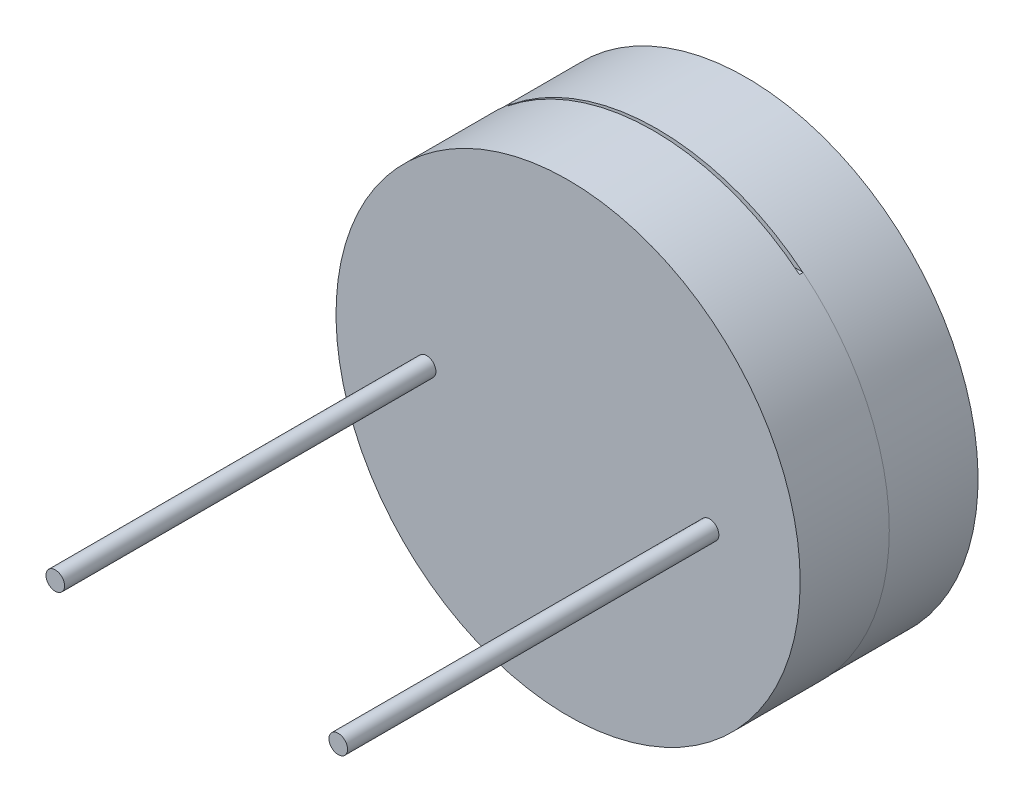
ISO-10303-21;
HEADER;
FILE_DESCRIPTION(('STEP AP214'),'2;1');
FILE_NAME('part.step','',(''),(''),'','','');
FILE_SCHEMA(('AUTOMOTIVE_DESIGN { 1 0 10303 214 1 1 1 1 }'));
ENDSEC;
DATA;
#1=APPLICATION_CONTEXT('core data for automotive mechanical design processes');
#2=APPLICATION_PROTOCOL_DEFINITION('international standard','automotive_design',2000,#1);
#3=PRODUCT_CONTEXT('',#1,'mechanical');
#4=PRODUCT('Part','Part','',(#3));
#5=PRODUCT_RELATED_PRODUCT_CATEGORY('part','',(#4));
#6=PRODUCT_DEFINITION_FORMATION('','',#4);
#7=PRODUCT_DEFINITION_CONTEXT('part definition',#1,'design');
#8=PRODUCT_DEFINITION('design','',#6,#7);
#9=PRODUCT_DEFINITION_SHAPE('','',#8);
#10=(LENGTH_UNIT() NAMED_UNIT(*) SI_UNIT(.MILLI.,.METRE.));
#11=(NAMED_UNIT(*) PLANE_ANGLE_UNIT() SI_UNIT($,.RADIAN.));
#12=(NAMED_UNIT(*) SI_UNIT($,.STERADIAN.) SOLID_ANGLE_UNIT());
#13=UNCERTAINTY_MEASURE_WITH_UNIT(LENGTH_MEASURE(1.E-05),#10,'distance_accuracy_value','');
#14=(GEOMETRIC_REPRESENTATION_CONTEXT(3) GLOBAL_UNCERTAINTY_ASSIGNED_CONTEXT((#13)) GLOBAL_UNIT_ASSIGNED_CONTEXT((#10,
#11,#12)) REPRESENTATION_CONTEXT('',''));
#15=CARTESIAN_POINT('',(0.,0.,0.));
#16=DIRECTION('',(0.,0.,1.));
#17=DIRECTION('',(1.,0.,0.));
#18=AXIS2_PLACEMENT_3D('',#15,#16,#17);
#19=CARTESIAN_POINT('',(0.,0.,2.4));
#20=DIRECTION('',(0.,0.,1.));
#21=DIRECTION('',(1.,0.,0.));
#22=AXIS2_PLACEMENT_3D('',#19,#20,#21);
#23=PLANE('',#22);
#24=CARTESIAN_POINT('',(3.81,0.,2.4));
#25=DIRECTION('',(0.,0.,1.));
#26=DIRECTION('',(1.,0.,0.));
#27=AXIS2_PLACEMENT_3D('',#24,#25,#26);
#28=CIRCLE('',#27,0.25);
#29=CARTESIAN_POINT('',(4.06,0.,2.4));
#30=VERTEX_POINT('',#29);
#31=EDGE_CURVE('E859',#30,#30,#28,.T.);
#32=ORIENTED_EDGE('',*,*,#31,.F.);
#33=EDGE_LOOP('',(#32));
#34=FACE_BOUND('',#33,.T.);
#35=CARTESIAN_POINT('',(0.,0.,2.4));
#36=DIRECTION('',(0.,0.,1.));
#37=DIRECTION('',(1.,0.,0.));
#38=AXIS2_PLACEMENT_3D('',#35,#36,#37);
#39=CIRCLE('',#38,6.25);
#40=CARTESIAN_POINT('',(6.25,0.,2.4));
#41=VERTEX_POINT('',#40);
#42=EDGE_CURVE('E11',#41,#41,#39,.T.);
#43=ORIENTED_EDGE('',*,*,#42,.T.);
#44=EDGE_LOOP('',(#43));
#45=FACE_BOUND('',#44,.T.);
#46=CARTESIAN_POINT('',(-3.81,0.,2.4));
#47=DIRECTION('',(0.,0.,1.));
#48=DIRECTION('',(-1.,0.,0.));
#49=AXIS2_PLACEMENT_3D('',#46,#47,#48);
#50=CIRCLE('',#49,0.25);
#51=CARTESIAN_POINT('',(-4.06,0.,2.4));
#52=VERTEX_POINT('',#51);
#53=EDGE_CURVE('E1324',#52,#52,#50,.T.);
#54=ORIENTED_EDGE('',*,*,#53,.F.);
#55=EDGE_LOOP('',(#54));
#56=FACE_BOUND('',#55,.T.);
#57=ADVANCED_FACE('F26',(#34,#45,#56),#23,.T.);
#58=CARTESIAN_POINT('',(0.,0.,0.));
#59=DIRECTION('',(0.,0.,1.));
#60=DIRECTION('',(1.,0.,0.));
#61=AXIS2_PLACEMENT_3D('',#58,#59,#60);
#62=PLANE('',#61);
#63=CARTESIAN_POINT('',(0.,0.,0.));
#64=DIRECTION('',(0.,0.,-1.));
#65=DIRECTION('',(-1.,0.,0.));
#66=AXIS2_PLACEMENT_3D('',#63,#64,#65);
#67=CIRCLE('',#66,6.24);
#68=CARTESIAN_POINT('',(3.91576917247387,4.85843100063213,0.));
#69=VERTEX_POINT('',#68);
#70=CARTESIAN_POINT('',(3.91576917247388,-4.85843100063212,0.));
#71=VERTEX_POINT('',#70);
#72=EDGE_CURVE('E368',#69,#71,#67,.T.);
#73=ORIENTED_EDGE('',*,*,#72,.F.);
#74=DIRECTION('',(-1.,0.,0.));
#75=VECTOR('',#74,1.);
#76=CARTESIAN_POINT('',(-14.3098280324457,4.85843100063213,0.));
#77=LINE('',#76,#75);
#78=CARTESIAN_POINT('',(3.93168516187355,4.85843100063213,0.));
#79=VERTEX_POINT('',#78);
#80=EDGE_CURVE('E377',#79,#69,#77,.T.);
#81=ORIENTED_EDGE('',*,*,#80,.F.);
#82=CARTESIAN_POINT('',(0.,0.,0.));
#83=DIRECTION('',(0.,0.,1.));
#84=DIRECTION('',(1.,0.,0.));
#85=AXIS2_PLACEMENT_3D('',#82,#83,#84);
#86=CIRCLE('',#85,6.25);
#87=CARTESIAN_POINT('',(3.93168516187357,-4.85843100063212,0.));
#88=VERTEX_POINT('',#87);
#89=EDGE_CURVE('E563',#88,#79,#86,.T.);
#90=ORIENTED_EDGE('',*,*,#89,.F.);
#91=DIRECTION('',(-1.,0.,0.));
#92=VECTOR('',#91,1.);
#93=CARTESIAN_POINT('',(-14.3098280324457,-4.85843100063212,0.));
#94=LINE('',#93,#92);
#95=EDGE_CURVE('E379',#88,#71,#94,.T.);
#96=ORIENTED_EDGE('',*,*,#95,.T.);
#97=EDGE_LOOP('',(#73,#81,#90,#96));
#98=FACE_BOUND('',#97,.T.);
#99=ADVANCED_FACE('F375',(#98),#62,.F.);
#100=CARTESIAN_POINT('',(-3.91576917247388,-4.85843100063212,0.));
#101=VERTEX_POINT('',#100);
#102=CARTESIAN_POINT('',(-3.91576917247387,4.85843100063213,0.));
#103=VERTEX_POINT('',#102);
#104=EDGE_CURVE('E370',#101,#103,#67,.T.);
#105=ORIENTED_EDGE('',*,*,#104,.F.);
#106=DIRECTION('',(-1.,0.,0.));
#107=VECTOR('',#106,1.);
#108=CARTESIAN_POINT('',(-14.3098280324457,-4.85843100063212,0.));
#109=LINE('',#108,#107);
#110=CARTESIAN_POINT('',(-3.92412236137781,-4.85843100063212,0.));
#111=VERTEX_POINT('',#110);
#112=EDGE_CURVE('E47',#101,#111,#109,.T.);
#113=ORIENTED_EDGE('',*,*,#112,.T.);
#114=DIRECTION('',(-0.562434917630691,-0.826841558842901,0.));
#115=VECTOR('',#114,1.);
#116=CARTESIAN_POINT('',(-4.90121062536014,-6.29485885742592,0.));
#117=LINE('',#116,#115);
#118=CARTESIAN_POINT('',(-3.92680563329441,-4.86237570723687,0.));
#119=VERTEX_POINT('',#118);
#120=EDGE_CURVE('E688',#111,#119,#117,.T.);
#121=ORIENTED_EDGE('',*,*,#120,.T.);
#122=CARTESIAN_POINT('',(-3.93168516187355,4.85843100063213,0.));
#123=VERTEX_POINT('',#122);
#124=EDGE_CURVE('E34',#123,#119,#86,.T.);
#125=ORIENTED_EDGE('',*,*,#124,.F.);
#126=DIRECTION('',(-1.,0.,0.));
#127=VECTOR('',#126,1.);
#128=CARTESIAN_POINT('',(-14.3098280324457,4.85843100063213,0.));
#129=LINE('',#128,#127);
#130=EDGE_CURVE('E41',#103,#123,#129,.T.);
#131=ORIENTED_EDGE('',*,*,#130,.F.);
#132=EDGE_LOOP('',(#105,#113,#121,#125,#131));
#133=FACE_BOUND('',#132,.T.);
#134=ADVANCED_FACE('F687',(#133),#62,.F.);
#135=CARTESIAN_POINT('',(0.,0.,2.4));
#136=DIRECTION('',(0.,0.,-1.));
#137=DIRECTION('',(-1.,0.,0.));
#138=AXIS2_PLACEMENT_3D('',#135,#136,#137);
#139=CYLINDRICAL_SURFACE('',#138,6.25);
#140=ORIENTED_EDGE('',*,*,#89,.T.);
#141=DIRECTION('',(0.,0.,-1.));
#142=VECTOR('',#141,1.);
#143=CARTESIAN_POINT('',(3.93168516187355,4.85843100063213,0.1));
#144=LINE('',#143,#142);
#145=CARTESIAN_POINT('',(3.93168516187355,4.85843100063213,0.1));
#146=VERTEX_POINT('',#145);
#147=EDGE_CURVE('E384',#146,#79,#144,.T.);
#148=ORIENTED_EDGE('',*,*,#147,.F.);
#149=CARTESIAN_POINT('',(0.,0.,0.1));
#150=DIRECTION('',(0.,0.,-1.));
#151=DIRECTION('',(-1.,0.,0.));
#152=AXIS2_PLACEMENT_3D('',#149,#150,#151);
#153=CIRCLE('',#152,6.25);
#154=CARTESIAN_POINT('',(-3.93168516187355,4.85843100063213,0.1));
#155=VERTEX_POINT('',#154);
#156=EDGE_CURVE('E502',#146,#155,#153,.F.);
#157=ORIENTED_EDGE('',*,*,#156,.T.);
#158=DIRECTION('',(0.,0.,-1.));
#159=VECTOR('',#158,1.);
#160=CARTESIAN_POINT('',(-3.93168516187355,4.85843100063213,0.1));
#161=LINE('',#160,#159);
#162=EDGE_CURVE('E633',#155,#123,#161,.T.);
#163=ORIENTED_EDGE('',*,*,#162,.T.);
#164=ORIENTED_EDGE('',*,*,#124,.T.);
#165=DIRECTION('',(0.,0.,-1.));
#166=VECTOR('',#165,1.);
#167=CARTESIAN_POINT('',(-3.92680563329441,-4.86237570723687,0.1));
#168=LINE('',#167,#166);
#169=CARTESIAN_POINT('',(-3.92680563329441,-4.86237570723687,0.1));
#170=VERTEX_POINT('',#169);
#171=EDGE_CURVE('E561',#170,#119,#168,.T.);
#172=ORIENTED_EDGE('',*,*,#171,.F.);
#173=CARTESIAN_POINT('',(3.93168516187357,-4.85843100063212,0.1));
#174=VERTEX_POINT('',#173);
#175=EDGE_CURVE('E506',#170,#174,#153,.F.);
#176=ORIENTED_EDGE('',*,*,#175,.T.);
#177=DIRECTION('',(0.,0.,-1.));
#178=VECTOR('',#177,1.);
#179=CARTESIAN_POINT('',(3.93168516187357,-4.85843100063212,0.1));
#180=LINE('',#179,#178);
#181=EDGE_CURVE('E564',#174,#88,#180,.T.);
#182=ORIENTED_EDGE('',*,*,#181,.T.);
#183=EDGE_LOOP('',(#140,#148,#157,#163,#164,#172,#176,#182));
#184=FACE_BOUND('',#183,.T.);
#185=ORIENTED_EDGE('',*,*,#42,.F.);
#186=EDGE_LOOP('',(#185));
#187=FACE_BOUND('',#186,.T.);
#188=ADVANCED_FACE('F28',(#184,#187),#139,.T.);
#189=CARTESIAN_POINT('',(-4.90121062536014,-6.29485885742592,0.1));
#190=DIRECTION('',(0.826841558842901,-0.562434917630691,0.));
#191=DIRECTION('',(0.562434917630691,0.826841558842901,0.));
#192=AXIS2_PLACEMENT_3D('',#189,#190,#191);
#193=PLANE('',#192);
#194=ORIENTED_EDGE('',*,*,#120,.F.);
#195=DIRECTION('',(0.,0.,-1.));
#196=VECTOR('',#195,1.);
#197=CARTESIAN_POINT('',(-3.92412236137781,-4.85843100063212,0.1));
#198=LINE('',#197,#196);
#199=CARTESIAN_POINT('',(-3.92412236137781,-4.85843100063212,0.1));
#200=VERTEX_POINT('',#199);
#201=EDGE_CURVE('E680',#200,#111,#198,.T.);
#202=ORIENTED_EDGE('',*,*,#201,.F.);
#203=DIRECTION('',(-0.562434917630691,-0.826841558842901,0.));
#204=VECTOR('',#203,1.);
#205=CARTESIAN_POINT('',(-4.90121062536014,-6.29485885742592,0.1));
#206=LINE('',#205,#204);
#207=EDGE_CURVE('E439',#200,#170,#206,.T.);
#208=ORIENTED_EDGE('',*,*,#207,.T.);
#209=ORIENTED_EDGE('',*,*,#171,.T.);
#210=EDGE_LOOP('',(#194,#202,#208,#209));
#211=FACE_BOUND('',#210,.T.);
#212=ADVANCED_FACE('F889',(#211),#193,.T.);
#213=CARTESIAN_POINT('',(-14.3098280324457,-4.85843100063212,0.1));
#214=DIRECTION('',(0.,-1.,0.));
#215=DIRECTION('',(0.,0.,-1.));
#216=AXIS2_PLACEMENT_3D('',#213,#214,#215);
#217=PLANE('',#216);
#218=ORIENTED_EDGE('',*,*,#95,.F.);
#219=ORIENTED_EDGE('',*,*,#181,.F.);
#220=DIRECTION('',(-1.,0.,0.));
#221=VECTOR('',#220,1.);
#222=CARTESIAN_POINT('',(-14.3098280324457,-4.85843100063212,0.1));
#223=LINE('',#222,#221);
#224=CARTESIAN_POINT('',(-3.36666666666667,-4.85843100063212,0.1));
#225=VERTEX_POINT('',#224);
#226=EDGE_CURVE('E559',#174,#225,#223,.T.);
#227=ORIENTED_EDGE('',*,*,#226,.T.);
#228=DIRECTION('',(0.,0.,-1.));
#229=VECTOR('',#228,1.);
#230=CARTESIAN_POINT('',(-3.36666666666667,-4.85843100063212,0.1));
#231=LINE('',#230,#229);
#232=CARTESIAN_POINT('',(-3.36666666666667,-4.85843100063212,0.));
#233=VERTEX_POINT('',#232);
#234=EDGE_CURVE('E567',#225,#233,#231,.T.);
#235=ORIENTED_EDGE('',*,*,#234,.T.);
#236=DIRECTION('',(1.,0.,0.));
#237=VECTOR('',#236,1.);
#238=CARTESIAN_POINT('',(-14.3098280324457,-4.85843100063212,0.));
#239=LINE('',#238,#237);
#240=EDGE_CURVE('E359',#233,#71,#239,.T.);
#241=ORIENTED_EDGE('',*,*,#240,.T.);
#242=EDGE_LOOP('',(#218,#219,#227,#235,#241));
#243=FACE_BOUND('',#242,.T.);
#244=ADVANCED_FACE('F892',(#243),#217,.T.);
#245=CARTESIAN_POINT('',(-3.36666666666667,0.105079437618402,0.1));
#246=DIRECTION('',(-1.,0.,0.));
#247=DIRECTION('',(0.,0.,1.));
#248=AXIS2_PLACEMENT_3D('',#245,#246,#247);
#249=PLANE('',#248);
#250=DIRECTION('',(0.,1.,0.));
#251=VECTOR('',#250,1.);
#252=CARTESIAN_POINT('',(-3.36666666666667,0.105079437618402,0.));
#253=LINE('',#252,#251);
#254=CARTESIAN_POINT('',(-3.36666666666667,-4.05843100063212,0.));
#255=VERTEX_POINT('',#254);
#256=EDGE_CURVE('E436',#233,#255,#253,.T.);
#257=ORIENTED_EDGE('',*,*,#256,.F.);
#258=ORIENTED_EDGE('',*,*,#234,.F.);
#259=DIRECTION('',(0.,1.,0.));
#260=VECTOR('',#259,1.);
#261=CARTESIAN_POINT('',(-3.36666666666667,0.105079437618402,0.1));
#262=LINE('',#261,#260);
#263=CARTESIAN_POINT('',(-3.36666666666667,-4.05843100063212,0.1));
#264=VERTEX_POINT('',#263);
#265=EDGE_CURVE('E557',#225,#264,#262,.T.);
#266=ORIENTED_EDGE('',*,*,#265,.T.);
#267=DIRECTION('',(0.,0.,-1.));
#268=VECTOR('',#267,1.);
#269=CARTESIAN_POINT('',(-3.36666666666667,-4.05843100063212,0.1));
#270=LINE('',#269,#268);
#271=EDGE_CURVE('E570',#264,#255,#270,.T.);
#272=ORIENTED_EDGE('',*,*,#271,.T.);
#273=EDGE_LOOP('',(#257,#258,#266,#272));
#274=FACE_BOUND('',#273,.T.);
#275=ADVANCED_FACE('F1020',(#274),#249,.T.);
#276=CARTESIAN_POINT('',(-14.3098280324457,-4.05843100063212,0.1));
#277=DIRECTION('',(0.,1.,0.));
#278=DIRECTION('',(-1.,0.,0.));
#279=AXIS2_PLACEMENT_3D('',#276,#277,#278);
#280=PLANE('',#279);
#281=DIRECTION('',(1.,0.,0.));
#282=VECTOR('',#281,1.);
#283=CARTESIAN_POINT('',(-14.3098280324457,-4.05843100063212,0.));
#284=LINE('',#283,#282);
#285=CARTESIAN_POINT('',(3.23333333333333,-4.05843100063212,0.));
#286=VERTEX_POINT('',#285);
#287=EDGE_CURVE('E434',#255,#286,#284,.T.);
#288=ORIENTED_EDGE('',*,*,#287,.F.);
#289=ORIENTED_EDGE('',*,*,#271,.F.);
#290=DIRECTION('',(1.,0.,0.));
#291=VECTOR('',#290,1.);
#292=CARTESIAN_POINT('',(-14.3098280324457,-4.05843100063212,0.1));
#293=LINE('',#292,#291);
#294=CARTESIAN_POINT('',(3.23333333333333,-4.05843100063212,0.1));
#295=VERTEX_POINT('',#294);
#296=EDGE_CURVE('E555',#264,#295,#293,.T.);
#297=ORIENTED_EDGE('',*,*,#296,.T.);
#298=DIRECTION('',(0.,0.,-1.));
#299=VECTOR('',#298,1.);
#300=CARTESIAN_POINT('',(3.23333333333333,-4.05843100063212,0.1));
#301=LINE('',#300,#299);
#302=EDGE_CURVE('E573',#295,#286,#301,.T.);
#303=ORIENTED_EDGE('',*,*,#302,.T.);
#304=EDGE_LOOP('',(#288,#289,#297,#303));
#305=FACE_BOUND('',#304,.T.);
#306=ADVANCED_FACE('F1016',(#305),#280,.T.);
#307=CARTESIAN_POINT('',(3.23333333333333,0.10507943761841,0.1));
#308=DIRECTION('',(-1.,0.,0.));
#309=DIRECTION('',(0.,-1.,0.));
#310=AXIS2_PLACEMENT_3D('',#307,#308,#309);
#311=PLANE('',#310);
#312=DIRECTION('',(0.,1.,0.));
#313=VECTOR('',#312,1.);
#314=CARTESIAN_POINT('',(3.23333333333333,0.10507943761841,0.));
#315=LINE('',#314,#313);
#316=CARTESIAN_POINT('',(3.23333333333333,-3.14731988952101,0.));
#317=VERTEX_POINT('',#316);
#318=EDGE_CURVE('E432',#286,#317,#315,.T.);
#319=ORIENTED_EDGE('',*,*,#318,.F.);
#320=ORIENTED_EDGE('',*,*,#302,.F.);
#321=DIRECTION('',(0.,1.,0.));
#322=VECTOR('',#321,1.);
#323=CARTESIAN_POINT('',(3.23333333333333,0.10507943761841,0.1));
#324=LINE('',#323,#322);
#325=CARTESIAN_POINT('',(3.23333333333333,-3.14731988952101,0.1));
#326=VERTEX_POINT('',#325);
#327=EDGE_CURVE('E553',#295,#326,#324,.T.);
#328=ORIENTED_EDGE('',*,*,#327,.T.);
#329=DIRECTION('',(0.,0.,-1.));
#330=VECTOR('',#329,1.);
#331=CARTESIAN_POINT('',(3.23333333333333,-3.14731988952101,0.1));
#332=LINE('',#331,#330);
#333=EDGE_CURVE('E576',#326,#317,#332,.T.);
#334=ORIENTED_EDGE('',*,*,#333,.T.);
#335=EDGE_LOOP('',(#319,#320,#328,#334));
#336=FACE_BOUND('',#335,.T.);
#337=ADVANCED_FACE('F1012',(#336),#311,.T.);
#338=CARTESIAN_POINT('',(-14.3098280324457,-3.14731988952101,0.1));
#339=DIRECTION('',(0.,-1.,0.));
#340=DIRECTION('',(0.,0.,-1.));
#341=AXIS2_PLACEMENT_3D('',#338,#339,#340);
#342=PLANE('',#341);
#343=DIRECTION('',(-1.,0.,0.));
#344=VECTOR('',#343,1.);
#345=CARTESIAN_POINT('',(-14.3098280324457,-3.14731988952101,0.));
#346=LINE('',#345,#344);
#347=CARTESIAN_POINT('',(-3.36666666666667,-3.14731988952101,0.));
#348=VERTEX_POINT('',#347);
#349=EDGE_CURVE('E430',#317,#348,#346,.T.);
#350=ORIENTED_EDGE('',*,*,#349,.F.);
#351=ORIENTED_EDGE('',*,*,#333,.F.);
#352=DIRECTION('',(-1.,0.,0.));
#353=VECTOR('',#352,1.);
#354=CARTESIAN_POINT('',(-14.3098280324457,-3.14731988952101,0.1));
#355=LINE('',#354,#353);
#356=CARTESIAN_POINT('',(-3.36666666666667,-3.14731988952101,0.1));
#357=VERTEX_POINT('',#356);
#358=EDGE_CURVE('E551',#326,#357,#355,.T.);
#359=ORIENTED_EDGE('',*,*,#358,.T.);
#360=DIRECTION('',(0.,0.,-1.));
#361=VECTOR('',#360,1.);
#362=CARTESIAN_POINT('',(-3.36666666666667,-3.14731988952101,0.1));
#363=LINE('',#362,#361);
#364=EDGE_CURVE('E579',#357,#348,#363,.T.);
#365=ORIENTED_EDGE('',*,*,#364,.T.);
#366=EDGE_LOOP('',(#350,#351,#359,#365));
#367=FACE_BOUND('',#366,.T.);
#368=ADVANCED_FACE('F1008',(#367),#342,.T.);
#369=CARTESIAN_POINT('',(-3.36666666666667,0.105079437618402,0.1));
#370=DIRECTION('',(-1.,0.,0.));
#371=DIRECTION('',(0.,0.,1.));
#372=AXIS2_PLACEMENT_3D('',#369,#370,#371);
#373=PLANE('',#372);
#374=DIRECTION('',(0.,1.,0.));
#375=VECTOR('',#374,1.);
#376=CARTESIAN_POINT('',(-3.36666666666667,0.105079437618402,0.));
#377=LINE('',#376,#375);
#378=CARTESIAN_POINT('',(-3.36666666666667,-2.24731988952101,0.));
#379=VERTEX_POINT('',#378);
#380=EDGE_CURVE('E428',#348,#379,#377,.T.);
#381=ORIENTED_EDGE('',*,*,#380,.F.);
#382=ORIENTED_EDGE('',*,*,#364,.F.);
#383=DIRECTION('',(0.,1.,0.));
#384=VECTOR('',#383,1.);
#385=CARTESIAN_POINT('',(-3.36666666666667,0.105079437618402,0.1));
#386=LINE('',#385,#384);
#387=CARTESIAN_POINT('',(-3.36666666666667,-2.24731988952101,0.1));
#388=VERTEX_POINT('',#387);
#389=EDGE_CURVE('E549',#357,#388,#386,.T.);
#390=ORIENTED_EDGE('',*,*,#389,.T.);
#391=DIRECTION('',(0.,0.,-1.));
#392=VECTOR('',#391,1.);
#393=CARTESIAN_POINT('',(-3.36666666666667,-2.24731988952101,0.1));
#394=LINE('',#393,#392);
#395=EDGE_CURVE('E582',#388,#379,#394,.T.);
#396=ORIENTED_EDGE('',*,*,#395,.T.);
#397=EDGE_LOOP('',(#381,#382,#390,#396));
#398=FACE_BOUND('',#397,.T.);
#399=ADVANCED_FACE('F1004',(#398),#373,.T.);
#400=CARTESIAN_POINT('',(-14.3098280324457,-2.24731988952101,0.1));
#401=DIRECTION('',(0.,1.,0.));
#402=DIRECTION('',(-1.,0.,0.));
#403=AXIS2_PLACEMENT_3D('',#400,#401,#402);
#404=PLANE('',#403);
#405=DIRECTION('',(1.,0.,0.));
#406=VECTOR('',#405,1.);
#407=CARTESIAN_POINT('',(-14.3098280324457,-2.24731988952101,0.));
#408=LINE('',#407,#406);
#409=CARTESIAN_POINT('',(3.23333333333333,-2.247319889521,0.));
#410=VERTEX_POINT('',#409);
#411=EDGE_CURVE('E426',#379,#410,#408,.T.);
#412=ORIENTED_EDGE('',*,*,#411,.F.);
#413=ORIENTED_EDGE('',*,*,#395,.F.);
#414=DIRECTION('',(1.,0.,0.));
#415=VECTOR('',#414,1.);
#416=CARTESIAN_POINT('',(-14.3098280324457,-2.24731988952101,0.1));
#417=LINE('',#416,#415);
#418=CARTESIAN_POINT('',(3.23333333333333,-2.247319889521,0.1));
#419=VERTEX_POINT('',#418);
#420=EDGE_CURVE('E547',#388,#419,#417,.T.);
#421=ORIENTED_EDGE('',*,*,#420,.T.);
#422=DIRECTION('',(0.,0.,-1.));
#423=VECTOR('',#422,1.);
#424=CARTESIAN_POINT('',(3.23333333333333,-2.247319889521,0.1));
#425=LINE('',#424,#423);
#426=EDGE_CURVE('E585',#419,#410,#425,.T.);
#427=ORIENTED_EDGE('',*,*,#426,.T.);
#428=EDGE_LOOP('',(#412,#413,#421,#427));
#429=FACE_BOUND('',#428,.T.);
#430=ADVANCED_FACE('F1000',(#429),#404,.T.);
#431=CARTESIAN_POINT('',(3.23333333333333,0.105079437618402,0.1));
#432=DIRECTION('',(-1.,0.,0.));
#433=DIRECTION('',(0.,0.,1.));
#434=AXIS2_PLACEMENT_3D('',#431,#432,#433);
#435=PLANE('',#434);
#436=DIRECTION('',(0.,1.,0.));
#437=VECTOR('',#436,1.);
#438=CARTESIAN_POINT('',(3.23333333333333,0.105079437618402,0.));
#439=LINE('',#438,#437);
#440=CARTESIAN_POINT('',(3.23333333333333,-1.347319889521,0.));
#441=VERTEX_POINT('',#440);
#442=EDGE_CURVE('E424',#410,#441,#439,.T.);
#443=ORIENTED_EDGE('',*,*,#442,.F.);
#444=ORIENTED_EDGE('',*,*,#426,.F.);
#445=DIRECTION('',(0.,1.,0.));
#446=VECTOR('',#445,1.);
#447=CARTESIAN_POINT('',(3.23333333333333,0.105079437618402,0.1));
#448=LINE('',#447,#446);
#449=CARTESIAN_POINT('',(3.23333333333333,-1.347319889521,0.1));
#450=VERTEX_POINT('',#449);
#451=EDGE_CURVE('E545',#419,#450,#448,.T.);
#452=ORIENTED_EDGE('',*,*,#451,.T.);
#453=DIRECTION('',(0.,0.,-1.));
#454=VECTOR('',#453,1.);
#455=CARTESIAN_POINT('',(3.23333333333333,-1.347319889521,0.1));
#456=LINE('',#455,#454);
#457=EDGE_CURVE('E588',#450,#441,#456,.T.);
#458=ORIENTED_EDGE('',*,*,#457,.T.);
#459=EDGE_LOOP('',(#443,#444,#452,#458));
#460=FACE_BOUND('',#459,.T.);
#461=ADVANCED_FACE('F996',(#460),#435,.T.);
#462=CARTESIAN_POINT('',(-14.3098280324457,-1.347319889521,0.1));
#463=DIRECTION('',(0.,-1.,0.));
#464=DIRECTION('',(0.,0.,-1.));
#465=AXIS2_PLACEMENT_3D('',#462,#463,#464);
#466=PLANE('',#465);
#467=DIRECTION('',(-1.,0.,0.));
#468=VECTOR('',#467,1.);
#469=CARTESIAN_POINT('',(-14.3098280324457,-1.347319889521,0.));
#470=LINE('',#469,#468);
#471=CARTESIAN_POINT('',(-3.36666666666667,-1.347319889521,0.));
#472=VERTEX_POINT('',#471);
#473=EDGE_CURVE('E422',#441,#472,#470,.T.);
#474=ORIENTED_EDGE('',*,*,#473,.F.);
#475=ORIENTED_EDGE('',*,*,#457,.F.);
#476=DIRECTION('',(-1.,0.,0.));
#477=VECTOR('',#476,1.);
#478=CARTESIAN_POINT('',(-14.3098280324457,-1.347319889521,0.1));
#479=LINE('',#478,#477);
#480=CARTESIAN_POINT('',(-3.36666666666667,-1.347319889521,0.1));
#481=VERTEX_POINT('',#480);
#482=EDGE_CURVE('E543',#450,#481,#479,.T.);
#483=ORIENTED_EDGE('',*,*,#482,.T.);
#484=DIRECTION('',(0.,0.,-1.));
#485=VECTOR('',#484,1.);
#486=CARTESIAN_POINT('',(-3.36666666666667,-1.347319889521,0.1));
#487=LINE('',#486,#485);
#488=EDGE_CURVE('E591',#481,#472,#487,.T.);
#489=ORIENTED_EDGE('',*,*,#488,.T.);
#490=EDGE_LOOP('',(#474,#475,#483,#489));
#491=FACE_BOUND('',#490,.T.);
#492=ADVANCED_FACE('F992',(#491),#466,.T.);
#493=CARTESIAN_POINT('',(-3.36666666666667,0.105079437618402,0.1));
#494=DIRECTION('',(-1.,0.,0.));
#495=DIRECTION('',(0.,0.,1.));
#496=AXIS2_PLACEMENT_3D('',#493,#494,#495);
#497=PLANE('',#496);
#498=DIRECTION('',(0.,1.,0.));
#499=VECTOR('',#498,1.);
#500=CARTESIAN_POINT('',(-3.36666666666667,0.105079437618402,0.));
#501=LINE('',#500,#499);
#502=CARTESIAN_POINT('',(-3.36666666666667,-0.447319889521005,0.));
#503=VERTEX_POINT('',#502);
#504=EDGE_CURVE('E420',#472,#503,#501,.T.);
#505=ORIENTED_EDGE('',*,*,#504,.F.);
#506=ORIENTED_EDGE('',*,*,#488,.F.);
#507=DIRECTION('',(0.,1.,0.));
#508=VECTOR('',#507,1.);
#509=CARTESIAN_POINT('',(-3.36666666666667,0.105079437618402,0.1));
#510=LINE('',#509,#508);
#511=CARTESIAN_POINT('',(-3.36666666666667,-0.447319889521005,0.1));
#512=VERTEX_POINT('',#511);
#513=EDGE_CURVE('E541',#481,#512,#510,.T.);
#514=ORIENTED_EDGE('',*,*,#513,.T.);
#515=DIRECTION('',(0.,0.,-1.));
#516=VECTOR('',#515,1.);
#517=CARTESIAN_POINT('',(-3.36666666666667,-0.447319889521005,0.1));
#518=LINE('',#517,#516);
#519=EDGE_CURVE('E594',#512,#503,#518,.T.);
#520=ORIENTED_EDGE('',*,*,#519,.T.);
#521=EDGE_LOOP('',(#505,#506,#514,#520));
#522=FACE_BOUND('',#521,.T.);
#523=ADVANCED_FACE('F988',(#522),#497,.T.);
#524=CARTESIAN_POINT('',(-14.3098280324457,-0.447319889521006,0.1));
#525=DIRECTION('',(0.,1.,0.));
#526=DIRECTION('',(-1.,0.,0.));
#527=AXIS2_PLACEMENT_3D('',#524,#525,#526);
#528=PLANE('',#527);
#529=DIRECTION('',(1.,0.,0.));
#530=VECTOR('',#529,1.);
#531=CARTESIAN_POINT('',(-14.3098280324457,-0.447319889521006,0.));
#532=LINE('',#531,#530);
#533=CARTESIAN_POINT('',(3.23333333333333,-0.447319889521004,0.));
#534=VERTEX_POINT('',#533);
#535=EDGE_CURVE('E418',#503,#534,#532,.T.);
#536=ORIENTED_EDGE('',*,*,#535,.F.);
#537=ORIENTED_EDGE('',*,*,#519,.F.);
#538=DIRECTION('',(1.,0.,0.));
#539=VECTOR('',#538,1.);
#540=CARTESIAN_POINT('',(-14.3098280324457,-0.447319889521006,0.1));
#541=LINE('',#540,#539);
#542=CARTESIAN_POINT('',(3.23333333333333,-0.447319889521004,0.1));
#543=VERTEX_POINT('',#542);
#544=EDGE_CURVE('E539',#512,#543,#541,.T.);
#545=ORIENTED_EDGE('',*,*,#544,.T.);
#546=DIRECTION('',(0.,0.,-1.));
#547=VECTOR('',#546,1.);
#548=CARTESIAN_POINT('',(3.23333333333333,-0.447319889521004,0.1));
#549=LINE('',#548,#547);
#550=EDGE_CURVE('E597',#543,#534,#549,.T.);
#551=ORIENTED_EDGE('',*,*,#550,.T.);
#552=EDGE_LOOP('',(#536,#537,#545,#551));
#553=FACE_BOUND('',#552,.T.);
#554=ADVANCED_FACE('F984',(#553),#528,.T.);
#555=CARTESIAN_POINT('',(3.23333333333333,0.105079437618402,0.1));
#556=DIRECTION('',(1.,0.,0.));
#557=DIRECTION('',(0.,0.,-1.));
#558=AXIS2_PLACEMENT_3D('',#555,#556,#557);
#559=PLANE('',#558);
#560=DIRECTION('',(0.,-1.,0.));
#561=VECTOR('',#560,1.);
#562=CARTESIAN_POINT('',(3.23333333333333,0.105079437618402,0.));
#563=LINE('',#562,#561);
#564=CARTESIAN_POINT('',(3.23333333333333,0.447319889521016,0.));
#565=VERTEX_POINT('',#564);
#566=EDGE_CURVE('E415',#565,#534,#563,.T.);
#567=ORIENTED_EDGE('',*,*,#566,.T.);
#568=ORIENTED_EDGE('',*,*,#550,.F.);
#569=DIRECTION('',(0.,-1.,0.));
#570=VECTOR('',#569,1.);
#571=CARTESIAN_POINT('',(3.23333333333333,0.105079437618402,0.1));
#572=LINE('',#571,#570);
#573=CARTESIAN_POINT('',(3.23333333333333,0.447319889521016,0.1));
#574=VERTEX_POINT('',#573);
#575=EDGE_CURVE('E536',#574,#543,#572,.T.);
#576=ORIENTED_EDGE('',*,*,#575,.F.);
#577=DIRECTION('',(0.,0.,-1.));
#578=VECTOR('',#577,1.);
#579=CARTESIAN_POINT('',(3.23333333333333,0.447319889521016,0.1));
#580=LINE('',#579,#578);
#581=EDGE_CURVE('E600',#574,#565,#580,.T.);
#582=ORIENTED_EDGE('',*,*,#581,.T.);
#583=EDGE_LOOP('',(#567,#568,#576,#582));
#584=FACE_BOUND('',#583,.T.);
#585=ADVANCED_FACE('F980',(#584),#559,.F.);
#586=CARTESIAN_POINT('',(-14.3098280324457,0.447319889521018,0.1));
#587=DIRECTION('',(0.,1.,0.));
#588=DIRECTION('',(-1.,0.,0.));
#589=AXIS2_PLACEMENT_3D('',#586,#587,#588);
#590=PLANE('',#589);
#591=DIRECTION('',(1.,0.,0.));
#592=VECTOR('',#591,1.);
#593=CARTESIAN_POINT('',(-14.3098280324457,0.447319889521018,0.));
#594=LINE('',#593,#592);
#595=CARTESIAN_POINT('',(-3.36666666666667,0.447319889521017,0.));
#596=VERTEX_POINT('',#595);
#597=EDGE_CURVE('E412',#596,#565,#594,.T.);
#598=ORIENTED_EDGE('',*,*,#597,.T.);
#599=ORIENTED_EDGE('',*,*,#581,.F.);
#600=DIRECTION('',(1.,0.,0.));
#601=VECTOR('',#600,1.);
#602=CARTESIAN_POINT('',(-14.3098280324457,0.447319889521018,0.1));
#603=LINE('',#602,#601);
#604=CARTESIAN_POINT('',(-3.36666666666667,0.447319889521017,0.1));
#605=VERTEX_POINT('',#604);
#606=EDGE_CURVE('E533',#605,#574,#603,.T.);
#607=ORIENTED_EDGE('',*,*,#606,.F.);
#608=DIRECTION('',(0.,0.,-1.));
#609=VECTOR('',#608,1.);
#610=CARTESIAN_POINT('',(-3.36666666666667,0.447319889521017,0.1));
#611=LINE('',#610,#609);
#612=EDGE_CURVE('E603',#605,#596,#611,.T.);
#613=ORIENTED_EDGE('',*,*,#612,.T.);
#614=EDGE_LOOP('',(#598,#599,#607,#613));
#615=FACE_BOUND('',#614,.T.);
#616=ADVANCED_FACE('F976',(#615),#590,.F.);
#617=CARTESIAN_POINT('',(-3.36666666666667,0.105079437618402,0.1));
#618=DIRECTION('',(-1.,0.,0.));
#619=DIRECTION('',(0.,0.,1.));
#620=AXIS2_PLACEMENT_3D('',#617,#618,#619);
#621=PLANE('',#620);
#622=DIRECTION('',(0.,1.,0.));
#623=VECTOR('',#622,1.);
#624=CARTESIAN_POINT('',(-3.36666666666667,0.105079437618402,0.));
#625=LINE('',#624,#623);
#626=CARTESIAN_POINT('',(-3.36666666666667,1.34731988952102,0.));
#627=VERTEX_POINT('',#626);
#628=EDGE_CURVE('E410',#596,#627,#625,.T.);
#629=ORIENTED_EDGE('',*,*,#628,.F.);
#630=ORIENTED_EDGE('',*,*,#612,.F.);
#631=DIRECTION('',(0.,1.,0.));
#632=VECTOR('',#631,1.);
#633=CARTESIAN_POINT('',(-3.36666666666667,0.105079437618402,0.1));
#634=LINE('',#633,#632);
#635=CARTESIAN_POINT('',(-3.36666666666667,1.34731988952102,0.1));
#636=VERTEX_POINT('',#635);
#637=EDGE_CURVE('E531',#605,#636,#634,.T.);
#638=ORIENTED_EDGE('',*,*,#637,.T.);
#639=DIRECTION('',(0.,0.,-1.));
#640=VECTOR('',#639,1.);
#641=CARTESIAN_POINT('',(-3.36666666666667,1.34731988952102,0.1));
#642=LINE('',#641,#640);
#643=EDGE_CURVE('E606',#636,#627,#642,.T.);
#644=ORIENTED_EDGE('',*,*,#643,.T.);
#645=EDGE_LOOP('',(#629,#630,#638,#644));
#646=FACE_BOUND('',#645,.T.);
#647=ADVANCED_FACE('F972',(#646),#621,.T.);
#648=CARTESIAN_POINT('',(-14.3098280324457,1.34731988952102,0.1));
#649=DIRECTION('',(0.,-1.,0.));
#650=DIRECTION('',(0.,0.,-1.));
#651=AXIS2_PLACEMENT_3D('',#648,#649,#650);
#652=PLANE('',#651);
#653=DIRECTION('',(-1.,0.,0.));
#654=VECTOR('',#653,1.);
#655=CARTESIAN_POINT('',(-14.3098280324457,1.34731988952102,0.));
#656=LINE('',#655,#654);
#657=CARTESIAN_POINT('',(3.23333333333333,1.34731988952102,0.));
#658=VERTEX_POINT('',#657);
#659=EDGE_CURVE('E407',#658,#627,#656,.T.);
#660=ORIENTED_EDGE('',*,*,#659,.T.);
#661=ORIENTED_EDGE('',*,*,#643,.F.);
#662=DIRECTION('',(-1.,0.,0.));
#663=VECTOR('',#662,1.);
#664=CARTESIAN_POINT('',(-14.3098280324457,1.34731988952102,0.1));
#665=LINE('',#664,#663);
#666=CARTESIAN_POINT('',(3.23333333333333,1.34731988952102,0.1));
#667=VERTEX_POINT('',#666);
#668=EDGE_CURVE('E528',#667,#636,#665,.T.);
#669=ORIENTED_EDGE('',*,*,#668,.F.);
#670=DIRECTION('',(0.,0.,-1.));
#671=VECTOR('',#670,1.);
#672=CARTESIAN_POINT('',(3.23333333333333,1.34731988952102,0.1));
#673=LINE('',#672,#671);
#674=EDGE_CURVE('E609',#667,#658,#673,.T.);
#675=ORIENTED_EDGE('',*,*,#674,.T.);
#676=EDGE_LOOP('',(#660,#661,#669,#675));
#677=FACE_BOUND('',#676,.T.);
#678=ADVANCED_FACE('F968',(#677),#652,.F.);
#679=CARTESIAN_POINT('',(3.23333333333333,0.105079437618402,0.1));
#680=DIRECTION('',(-1.,0.,0.));
#681=DIRECTION('',(0.,0.,1.));
#682=AXIS2_PLACEMENT_3D('',#679,#680,#681);
#683=PLANE('',#682);
#684=DIRECTION('',(0.,1.,0.));
#685=VECTOR('',#684,1.);
#686=CARTESIAN_POINT('',(3.23333333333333,0.105079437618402,0.));
#687=LINE('',#686,#685);
#688=CARTESIAN_POINT('',(3.23333333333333,2.24731988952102,0.));
#689=VERTEX_POINT('',#688);
#690=EDGE_CURVE('E405',#658,#689,#687,.T.);
#691=ORIENTED_EDGE('',*,*,#690,.F.);
#692=ORIENTED_EDGE('',*,*,#674,.F.);
#693=DIRECTION('',(0.,1.,0.));
#694=VECTOR('',#693,1.);
#695=CARTESIAN_POINT('',(3.23333333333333,0.105079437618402,0.1));
#696=LINE('',#695,#694);
#697=CARTESIAN_POINT('',(3.23333333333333,2.24731988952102,0.1));
#698=VERTEX_POINT('',#697);
#699=EDGE_CURVE('E526',#667,#698,#696,.T.);
#700=ORIENTED_EDGE('',*,*,#699,.T.);
#701=DIRECTION('',(0.,0.,-1.));
#702=VECTOR('',#701,1.);
#703=CARTESIAN_POINT('',(3.23333333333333,2.24731988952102,0.1));
#704=LINE('',#703,#702);
#705=EDGE_CURVE('E612',#698,#689,#704,.T.);
#706=ORIENTED_EDGE('',*,*,#705,.T.);
#707=EDGE_LOOP('',(#691,#692,#700,#706));
#708=FACE_BOUND('',#707,.T.);
#709=ADVANCED_FACE('F964',(#708),#683,.T.);
#710=CARTESIAN_POINT('',(-14.3098280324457,2.24731988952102,0.1));
#711=DIRECTION('',(0.,1.,0.));
#712=DIRECTION('',(-1.,0.,0.));
#713=AXIS2_PLACEMENT_3D('',#710,#711,#712);
#714=PLANE('',#713);
#715=DIRECTION('',(1.,0.,0.));
#716=VECTOR('',#715,1.);
#717=CARTESIAN_POINT('',(-14.3098280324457,2.24731988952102,0.));
#718=LINE('',#717,#716);
#719=CARTESIAN_POINT('',(-3.36666666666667,2.24731988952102,0.));
#720=VERTEX_POINT('',#719);
#721=EDGE_CURVE('E402',#720,#689,#718,.T.);
#722=ORIENTED_EDGE('',*,*,#721,.T.);
#723=ORIENTED_EDGE('',*,*,#705,.F.);
#724=DIRECTION('',(1.,0.,0.));
#725=VECTOR('',#724,1.);
#726=CARTESIAN_POINT('',(-14.3098280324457,2.24731988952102,0.1));
#727=LINE('',#726,#725);
#728=CARTESIAN_POINT('',(-3.36666666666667,2.24731988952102,0.1));
#729=VERTEX_POINT('',#728);
#730=EDGE_CURVE('E523',#729,#698,#727,.T.);
#731=ORIENTED_EDGE('',*,*,#730,.F.);
#732=DIRECTION('',(0.,0.,-1.));
#733=VECTOR('',#732,1.);
#734=CARTESIAN_POINT('',(-3.36666666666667,2.24731988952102,0.1));
#735=LINE('',#734,#733);
#736=EDGE_CURVE('E615',#729,#720,#735,.T.);
#737=ORIENTED_EDGE('',*,*,#736,.T.);
#738=EDGE_LOOP('',(#722,#723,#731,#737));
#739=FACE_BOUND('',#738,.T.);
#740=ADVANCED_FACE('F960',(#739),#714,.F.);
#741=CARTESIAN_POINT('',(-3.36666666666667,0.105079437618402,0.1));
#742=DIRECTION('',(-1.,0.,0.));
#743=DIRECTION('',(0.,0.,1.));
#744=AXIS2_PLACEMENT_3D('',#741,#742,#743);
#745=PLANE('',#744);
#746=DIRECTION('',(0.,1.,0.));
#747=VECTOR('',#746,1.);
#748=CARTESIAN_POINT('',(-3.36666666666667,0.105079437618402,0.));
#749=LINE('',#748,#747);
#750=CARTESIAN_POINT('',(-3.36666666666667,3.14731988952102,0.));
#751=VERTEX_POINT('',#750);
#752=EDGE_CURVE('E400',#720,#751,#749,.T.);
#753=ORIENTED_EDGE('',*,*,#752,.F.);
#754=ORIENTED_EDGE('',*,*,#736,.F.);
#755=DIRECTION('',(0.,1.,0.));
#756=VECTOR('',#755,1.);
#757=CARTESIAN_POINT('',(-3.36666666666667,0.105079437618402,0.1));
#758=LINE('',#757,#756);
#759=CARTESIAN_POINT('',(-3.36666666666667,3.14731988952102,0.1));
#760=VERTEX_POINT('',#759);
#761=EDGE_CURVE('E521',#729,#760,#758,.T.);
#762=ORIENTED_EDGE('',*,*,#761,.T.);
#763=DIRECTION('',(0.,0.,-1.));
#764=VECTOR('',#763,1.);
#765=CARTESIAN_POINT('',(-3.36666666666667,3.14731988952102,0.1));
#766=LINE('',#765,#764);
#767=EDGE_CURVE('E618',#760,#751,#766,.T.);
#768=ORIENTED_EDGE('',*,*,#767,.T.);
#769=EDGE_LOOP('',(#753,#754,#762,#768));
#770=FACE_BOUND('',#769,.T.);
#771=ADVANCED_FACE('F956',(#770),#745,.T.);
#772=CARTESIAN_POINT('',(-14.3098280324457,3.14731988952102,0.1));
#773=DIRECTION('',(0.,-1.,0.));
#774=DIRECTION('',(0.,0.,-1.));
#775=AXIS2_PLACEMENT_3D('',#772,#773,#774);
#776=PLANE('',#775);
#777=DIRECTION('',(-1.,0.,0.));
#778=VECTOR('',#777,1.);
#779=CARTESIAN_POINT('',(-14.3098280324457,3.14731988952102,0.));
#780=LINE('',#779,#778);
#781=CARTESIAN_POINT('',(3.23333333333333,3.14731988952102,0.));
#782=VERTEX_POINT('',#781);
#783=EDGE_CURVE('E397',#782,#751,#780,.T.);
#784=ORIENTED_EDGE('',*,*,#783,.T.);
#785=ORIENTED_EDGE('',*,*,#767,.F.);
#786=DIRECTION('',(-1.,0.,0.));
#787=VECTOR('',#786,1.);
#788=CARTESIAN_POINT('',(-14.3098280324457,3.14731988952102,0.1));
#789=LINE('',#788,#787);
#790=CARTESIAN_POINT('',(3.23333333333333,3.14731988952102,0.1));
#791=VERTEX_POINT('',#790);
#792=EDGE_CURVE('E518',#791,#760,#789,.T.);
#793=ORIENTED_EDGE('',*,*,#792,.F.);
#794=DIRECTION('',(0.,0.,-1.));
#795=VECTOR('',#794,1.);
#796=CARTESIAN_POINT('',(3.23333333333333,3.14731988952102,0.1));
#797=LINE('',#796,#795);
#798=EDGE_CURVE('E621',#791,#782,#797,.T.);
#799=ORIENTED_EDGE('',*,*,#798,.T.);
#800=EDGE_LOOP('',(#784,#785,#793,#799));
#801=FACE_BOUND('',#800,.T.);
#802=ADVANCED_FACE('F952',(#801),#776,.F.);
#803=CARTESIAN_POINT('',(3.23333333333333,0.105079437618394,0.1));
#804=DIRECTION('',(1.,0.,0.));
#805=DIRECTION('',(0.,1.,0.));
#806=AXIS2_PLACEMENT_3D('',#803,#804,#805);
#807=PLANE('',#806);
#808=DIRECTION('',(0.,-1.,0.));
#809=VECTOR('',#808,1.);
#810=CARTESIAN_POINT('',(3.23333333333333,0.105079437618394,0.));
#811=LINE('',#810,#809);
#812=CARTESIAN_POINT('',(3.23333333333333,4.05843100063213,0.));
#813=VERTEX_POINT('',#812);
#814=EDGE_CURVE('E394',#813,#782,#811,.T.);
#815=ORIENTED_EDGE('',*,*,#814,.T.);
#816=ORIENTED_EDGE('',*,*,#798,.F.);
#817=DIRECTION('',(0.,-1.,0.));
#818=VECTOR('',#817,1.);
#819=CARTESIAN_POINT('',(3.23333333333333,0.105079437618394,0.1));
#820=LINE('',#819,#818);
#821=CARTESIAN_POINT('',(3.23333333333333,4.05843100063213,0.1));
#822=VERTEX_POINT('',#821);
#823=EDGE_CURVE('E515',#822,#791,#820,.T.);
#824=ORIENTED_EDGE('',*,*,#823,.F.);
#825=DIRECTION('',(0.,0.,-1.));
#826=VECTOR('',#825,1.);
#827=CARTESIAN_POINT('',(3.23333333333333,4.05843100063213,0.1));
#828=LINE('',#827,#826);
#829=EDGE_CURVE('E624',#822,#813,#828,.T.);
#830=ORIENTED_EDGE('',*,*,#829,.T.);
#831=EDGE_LOOP('',(#815,#816,#824,#830));
#832=FACE_BOUND('',#831,.T.);
#833=ADVANCED_FACE('F948',(#832),#807,.F.);
#834=CARTESIAN_POINT('',(-14.3098280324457,4.05843100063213,0.1));
#835=DIRECTION('',(0.,1.,0.));
#836=DIRECTION('',(-1.,0.,0.));
#837=AXIS2_PLACEMENT_3D('',#834,#835,#836);
#838=PLANE('',#837);
#839=DIRECTION('',(1.,0.,0.));
#840=VECTOR('',#839,1.);
#841=CARTESIAN_POINT('',(-14.3098280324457,4.05843100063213,0.));
#842=LINE('',#841,#840);
#843=CARTESIAN_POINT('',(-3.36666666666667,4.05843100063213,0.));
#844=VERTEX_POINT('',#843);
#845=EDGE_CURVE('E387',#844,#813,#842,.T.);
#846=ORIENTED_EDGE('',*,*,#845,.T.);
#847=ORIENTED_EDGE('',*,*,#829,.F.);
#848=DIRECTION('',(1.,0.,0.));
#849=VECTOR('',#848,1.);
#850=CARTESIAN_POINT('',(-14.3098280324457,4.05843100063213,0.1));
#851=LINE('',#850,#849);
#852=CARTESIAN_POINT('',(-3.36666666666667,4.05843100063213,0.1));
#853=VERTEX_POINT('',#852);
#854=EDGE_CURVE('E512',#853,#822,#851,.T.);
#855=ORIENTED_EDGE('',*,*,#854,.F.);
#856=DIRECTION('',(0.,0.,-1.));
#857=VECTOR('',#856,1.);
#858=CARTESIAN_POINT('',(-3.36666666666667,4.05843100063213,0.1));
#859=LINE('',#858,#857);
#860=EDGE_CURVE('E627',#853,#844,#859,.T.);
#861=ORIENTED_EDGE('',*,*,#860,.T.);
#862=EDGE_LOOP('',(#846,#847,#855,#861));
#863=FACE_BOUND('',#862,.T.);
#864=ADVANCED_FACE('F944',(#863),#838,.F.);
#865=CARTESIAN_POINT('',(-3.36666666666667,0.105079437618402,0.1));
#866=DIRECTION('',(1.,0.,0.));
#867=DIRECTION('',(0.,0.,-1.));
#868=AXIS2_PLACEMENT_3D('',#865,#866,#867);
#869=PLANE('',#868);
#870=DIRECTION('',(0.,-1.,0.));
#871=VECTOR('',#870,1.);
#872=CARTESIAN_POINT('',(-3.36666666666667,0.105079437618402,0.));
#873=LINE('',#872,#871);
#874=CARTESIAN_POINT('',(-3.36666666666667,4.85843100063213,0.));
#875=VERTEX_POINT('',#874);
#876=EDGE_CURVE('E355',#875,#844,#873,.T.);
#877=ORIENTED_EDGE('',*,*,#876,.T.);
#878=ORIENTED_EDGE('',*,*,#860,.F.);
#879=DIRECTION('',(0.,-1.,0.));
#880=VECTOR('',#879,1.);
#881=CARTESIAN_POINT('',(-3.36666666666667,0.105079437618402,0.1));
#882=LINE('',#881,#880);
#883=CARTESIAN_POINT('',(-3.36666666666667,4.85843100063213,0.1));
#884=VERTEX_POINT('',#883);
#885=EDGE_CURVE('E509',#884,#853,#882,.T.);
#886=ORIENTED_EDGE('',*,*,#885,.F.);
#887=DIRECTION('',(0.,0.,-1.));
#888=VECTOR('',#887,1.);
#889=CARTESIAN_POINT('',(-3.36666666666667,4.85843100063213,0.1));
#890=LINE('',#889,#888);
#891=EDGE_CURVE('E630',#884,#875,#890,.T.);
#892=ORIENTED_EDGE('',*,*,#891,.T.);
#893=EDGE_LOOP('',(#877,#878,#886,#892));
#894=FACE_BOUND('',#893,.T.);
#895=ADVANCED_FACE('F941',(#894),#869,.F.);
#896=CARTESIAN_POINT('',(-14.3098280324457,4.85843100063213,0.1));
#897=DIRECTION('',(0.,-1.,0.));
#898=DIRECTION('',(0.,0.,-1.));
#899=AXIS2_PLACEMENT_3D('',#896,#897,#898);
#900=PLANE('',#899);
#901=ORIENTED_EDGE('',*,*,#80,.T.);
#902=DIRECTION('',(1.,0.,0.));
#903=VECTOR('',#902,1.);
#904=CARTESIAN_POINT('',(-14.3098280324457,4.85843100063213,0.));
#905=LINE('',#904,#903);
#906=EDGE_CURVE('E349',#875,#69,#905,.T.);
#907=ORIENTED_EDGE('',*,*,#906,.F.);
#908=ORIENTED_EDGE('',*,*,#891,.F.);
#909=DIRECTION('',(-1.,0.,0.));
#910=VECTOR('',#909,1.);
#911=CARTESIAN_POINT('',(-14.3098280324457,4.85843100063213,0.1));
#912=LINE('',#911,#910);
#913=EDGE_CURVE('E505',#146,#884,#912,.T.);
#914=ORIENTED_EDGE('',*,*,#913,.F.);
#915=ORIENTED_EDGE('',*,*,#147,.T.);
#916=EDGE_LOOP('',(#901,#907,#908,#914,#915));
#917=FACE_BOUND('',#916,.T.);
#918=ADVANCED_FACE('F381',(#917),#900,.F.);
#919=CARTESIAN_POINT('',(-14.3098280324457,4.85843100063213,0.1));
#920=DIRECTION('',(0.,-1.,0.));
#921=DIRECTION('',(0.,0.,-1.));
#922=AXIS2_PLACEMENT_3D('',#919,#920,#921);
#923=PLANE('',#922);
#924=CARTESIAN_POINT('',(-3.56666666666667,4.85843100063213,0.));
#925=VERTEX_POINT('',#924);
#926=EDGE_CURVE('E385',#925,#103,#129,.T.);
#927=ORIENTED_EDGE('',*,*,#926,.T.);
#928=ORIENTED_EDGE('',*,*,#130,.T.);
#929=ORIENTED_EDGE('',*,*,#162,.F.);
#930=DIRECTION('',(-1.,0.,0.));
#931=VECTOR('',#930,1.);
#932=CARTESIAN_POINT('',(-14.3098280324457,4.85843100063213,0.1));
#933=LINE('',#932,#931);
#934=CARTESIAN_POINT('',(-3.56666666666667,4.85843100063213,0.1));
#935=VERTEX_POINT('',#934);
#936=EDGE_CURVE('E499',#935,#155,#933,.T.);
#937=ORIENTED_EDGE('',*,*,#936,.F.);
#938=DIRECTION('',(0.,0.,-1.));
#939=VECTOR('',#938,1.);
#940=CARTESIAN_POINT('',(-3.56666666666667,4.85843100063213,0.1));
#941=LINE('',#940,#939);
#942=EDGE_CURVE('E636',#935,#925,#941,.T.);
#943=ORIENTED_EDGE('',*,*,#942,.T.);
#944=EDGE_LOOP('',(#927,#928,#929,#937,#943));
#945=FACE_BOUND('',#944,.T.);
#946=ADVANCED_FACE('F760',(#945),#923,.F.);
#947=CARTESIAN_POINT('',(-3.56666666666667,0.105079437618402,0.1));
#948=DIRECTION('',(1.,0.,0.));
#949=DIRECTION('',(0.,0.,-1.));
#950=AXIS2_PLACEMENT_3D('',#947,#948,#949);
#951=PLANE('',#950);
#952=DIRECTION('',(0.,-1.,0.));
#953=VECTOR('',#952,1.);
#954=CARTESIAN_POINT('',(-3.56666666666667,0.105079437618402,0.));
#955=LINE('',#954,#953);
#956=CARTESIAN_POINT('',(-3.56666666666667,3.85843100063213,0.));
#957=VERTEX_POINT('',#956);
#958=EDGE_CURVE('E756',#925,#957,#955,.T.);
#959=ORIENTED_EDGE('',*,*,#958,.F.);
#960=ORIENTED_EDGE('',*,*,#942,.F.);
#961=DIRECTION('',(0.,-1.,0.));
#962=VECTOR('',#961,1.);
#963=CARTESIAN_POINT('',(-3.56666666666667,0.105079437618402,0.1));
#964=LINE('',#963,#962);
#965=CARTESIAN_POINT('',(-3.56666666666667,3.85843100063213,0.1));
#966=VERTEX_POINT('',#965);
#967=EDGE_CURVE('E497',#935,#966,#964,.T.);
#968=ORIENTED_EDGE('',*,*,#967,.T.);
#969=DIRECTION('',(0.,0.,-1.));
#970=VECTOR('',#969,1.);
#971=CARTESIAN_POINT('',(-3.56666666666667,3.85843100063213,0.1));
#972=LINE('',#971,#970);
#973=EDGE_CURVE('E638',#966,#957,#972,.T.);
#974=ORIENTED_EDGE('',*,*,#973,.T.);
#975=EDGE_LOOP('',(#959,#960,#968,#974));
#976=FACE_BOUND('',#975,.T.);
#977=ADVANCED_FACE('F764',(#976),#951,.T.);
#978=CARTESIAN_POINT('',(-14.3098280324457,3.85843100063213,0.1));
#979=DIRECTION('',(0.,1.,0.));
#980=DIRECTION('',(0.,0.,1.));
#981=AXIS2_PLACEMENT_3D('',#978,#979,#980);
#982=PLANE('',#981);
#983=DIRECTION('',(1.,0.,0.));
#984=VECTOR('',#983,1.);
#985=CARTESIAN_POINT('',(-14.3098280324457,3.85843100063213,0.));
#986=LINE('',#985,#984);
#987=CARTESIAN_POINT('',(3.03333333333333,3.85843100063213,0.));
#988=VERTEX_POINT('',#987);
#989=EDGE_CURVE('E754',#957,#988,#986,.T.);
#990=ORIENTED_EDGE('',*,*,#989,.F.);
#991=ORIENTED_EDGE('',*,*,#973,.F.);
#992=DIRECTION('',(1.,0.,0.));
#993=VECTOR('',#992,1.);
#994=CARTESIAN_POINT('',(-14.3098280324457,3.85843100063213,0.1));
#995=LINE('',#994,#993);
#996=CARTESIAN_POINT('',(3.03333333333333,3.85843100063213,0.1));
#997=VERTEX_POINT('',#996);
#998=EDGE_CURVE('E495',#966,#997,#995,.T.);
#999=ORIENTED_EDGE('',*,*,#998,.T.);
#1000=DIRECTION('',(0.,0.,-1.));
#1001=VECTOR('',#1000,1.);
#1002=CARTESIAN_POINT('',(3.03333333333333,3.85843100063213,0.1));
#1003=LINE('',#1002,#1001);
#1004=EDGE_CURVE('E640',#997,#988,#1003,.T.);
#1005=ORIENTED_EDGE('',*,*,#1004,.T.);
#1006=EDGE_LOOP('',(#990,#991,#999,#1005));
#1007=FACE_BOUND('',#1006,.T.);
#1008=ADVANCED_FACE('F769',(#1007),#982,.T.);
#1009=CARTESIAN_POINT('',(3.03333333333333,0.105079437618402,0.1));
#1010=DIRECTION('',(1.,0.,0.));
#1011=DIRECTION('',(0.,0.,-1.));
#1012=AXIS2_PLACEMENT_3D('',#1009,#1010,#1011);
#1013=PLANE('',#1012);
#1014=DIRECTION('',(0.,-1.,0.));
#1015=VECTOR('',#1014,1.);
#1016=CARTESIAN_POINT('',(3.03333333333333,0.105079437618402,0.));
#1017=LINE('',#1016,#1015);
#1018=CARTESIAN_POINT('',(3.03333333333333,3.34731988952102,0.));
#1019=VERTEX_POINT('',#1018);
#1020=EDGE_CURVE('E751',#988,#1019,#1017,.T.);
#1021=ORIENTED_EDGE('',*,*,#1020,.F.);
#1022=ORIENTED_EDGE('',*,*,#1004,.F.);
#1023=DIRECTION('',(0.,-1.,0.));
#1024=VECTOR('',#1023,1.);
#1025=CARTESIAN_POINT('',(3.03333333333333,0.105079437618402,0.1));
#1026=LINE('',#1025,#1024);
#1027=CARTESIAN_POINT('',(3.03333333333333,3.34731988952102,0.1));
#1028=VERTEX_POINT('',#1027);
#1029=EDGE_CURVE('E493',#997,#1028,#1026,.T.);
#1030=ORIENTED_EDGE('',*,*,#1029,.T.);
#1031=DIRECTION('',(0.,0.,-1.));
#1032=VECTOR('',#1031,1.);
#1033=CARTESIAN_POINT('',(3.03333333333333,3.34731988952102,0.1));
#1034=LINE('',#1033,#1032);
#1035=EDGE_CURVE('E642',#1028,#1019,#1034,.T.);
#1036=ORIENTED_EDGE('',*,*,#1035,.T.);
#1037=EDGE_LOOP('',(#1021,#1022,#1030,#1036));
#1038=FACE_BOUND('',#1037,.T.);
#1039=ADVANCED_FACE('F775',(#1038),#1013,.T.);
#1040=CARTESIAN_POINT('',(-14.3098280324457,3.34731988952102,0.1));
#1041=DIRECTION('',(0.,-1.,0.));
#1042=DIRECTION('',(0.,0.,-1.));
#1043=AXIS2_PLACEMENT_3D('',#1040,#1041,#1042);
#1044=PLANE('',#1043);
#1045=DIRECTION('',(-1.,0.,0.));
#1046=VECTOR('',#1045,1.);
#1047=CARTESIAN_POINT('',(-14.3098280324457,3.34731988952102,0.));
#1048=LINE('',#1047,#1046);
#1049=CARTESIAN_POINT('',(-3.56666666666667,3.34731988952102,0.));
#1050=VERTEX_POINT('',#1049);
#1051=EDGE_CURVE('E748',#1019,#1050,#1048,.T.);
#1052=ORIENTED_EDGE('',*,*,#1051,.F.);
#1053=ORIENTED_EDGE('',*,*,#1035,.F.);
#1054=DIRECTION('',(-1.,0.,0.));
#1055=VECTOR('',#1054,1.);
#1056=CARTESIAN_POINT('',(-14.3098280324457,3.34731988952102,0.1));
#1057=LINE('',#1056,#1055);
#1058=CARTESIAN_POINT('',(-3.56666666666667,3.34731988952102,0.1));
#1059=VERTEX_POINT('',#1058);
#1060=EDGE_CURVE('E491',#1028,#1059,#1057,.T.);
#1061=ORIENTED_EDGE('',*,*,#1060,.T.);
#1062=DIRECTION('',(0.,0.,-1.));
#1063=VECTOR('',#1062,1.);
#1064=CARTESIAN_POINT('',(-3.56666666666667,3.34731988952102,0.1));
#1065=LINE('',#1064,#1063);
#1066=EDGE_CURVE('E644',#1059,#1050,#1065,.T.);
#1067=ORIENTED_EDGE('',*,*,#1066,.T.);
#1068=EDGE_LOOP('',(#1052,#1053,#1061,#1067));
#1069=FACE_BOUND('',#1068,.T.);
#1070=ADVANCED_FACE('F780',(#1069),#1044,.T.);
#1071=CARTESIAN_POINT('',(-3.56666666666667,0.105079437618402,0.1));
#1072=DIRECTION('',(-1.,0.,0.));
#1073=DIRECTION('',(0.,0.,1.));
#1074=AXIS2_PLACEMENT_3D('',#1071,#1072,#1073);
#1075=PLANE('',#1074);
#1076=DIRECTION('',(0.,1.,0.));
#1077=VECTOR('',#1076,1.);
#1078=CARTESIAN_POINT('',(-3.56666666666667,0.105079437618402,0.));
#1079=LINE('',#1078,#1077);
#1080=CARTESIAN_POINT('',(-3.56666666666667,2.04731988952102,0.));
#1081=VERTEX_POINT('',#1080);
#1082=EDGE_CURVE('E745',#1081,#1050,#1079,.T.);
#1083=ORIENTED_EDGE('',*,*,#1082,.T.);
#1084=ORIENTED_EDGE('',*,*,#1066,.F.);
#1085=DIRECTION('',(0.,1.,0.));
#1086=VECTOR('',#1085,1.);
#1087=CARTESIAN_POINT('',(-3.56666666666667,0.105079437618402,0.1));
#1088=LINE('',#1087,#1086);
#1089=CARTESIAN_POINT('',(-3.56666666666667,2.04731988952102,0.1));
#1090=VERTEX_POINT('',#1089);
#1091=EDGE_CURVE('E488',#1090,#1059,#1088,.T.);
#1092=ORIENTED_EDGE('',*,*,#1091,.F.);
#1093=DIRECTION('',(0.,0.,-1.));
#1094=VECTOR('',#1093,1.);
#1095=CARTESIAN_POINT('',(-3.56666666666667,2.04731988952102,0.1));
#1096=LINE('',#1095,#1094);
#1097=EDGE_CURVE('E646',#1090,#1081,#1096,.T.);
#1098=ORIENTED_EDGE('',*,*,#1097,.T.);
#1099=EDGE_LOOP('',(#1083,#1084,#1092,#1098));
#1100=FACE_BOUND('',#1099,.T.);
#1101=ADVANCED_FACE('F784',(#1100),#1075,.F.);
#1102=CARTESIAN_POINT('',(-14.3098280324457,2.04731988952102,0.1));
#1103=DIRECTION('',(0.,1.,0.));
#1104=DIRECTION('',(0.,0.,1.));
#1105=AXIS2_PLACEMENT_3D('',#1102,#1103,#1104);
#1106=PLANE('',#1105);
#1107=DIRECTION('',(1.,0.,0.));
#1108=VECTOR('',#1107,1.);
#1109=CARTESIAN_POINT('',(-14.3098280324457,2.04731988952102,0.));
#1110=LINE('',#1109,#1108);
#1111=CARTESIAN_POINT('',(3.03333333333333,2.04731988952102,0.));
#1112=VERTEX_POINT('',#1111);
#1113=EDGE_CURVE('E742',#1081,#1112,#1110,.T.);
#1114=ORIENTED_EDGE('',*,*,#1113,.F.);
#1115=ORIENTED_EDGE('',*,*,#1097,.F.);
#1116=DIRECTION('',(1.,0.,0.));
#1117=VECTOR('',#1116,1.);
#1118=CARTESIAN_POINT('',(-14.3098280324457,2.04731988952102,0.1));
#1119=LINE('',#1118,#1117);
#1120=CARTESIAN_POINT('',(3.03333333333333,2.04731988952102,0.1));
#1121=VERTEX_POINT('',#1120);
#1122=EDGE_CURVE('E486',#1090,#1121,#1119,.T.);
#1123=ORIENTED_EDGE('',*,*,#1122,.T.);
#1124=DIRECTION('',(0.,0.,-1.));
#1125=VECTOR('',#1124,1.);
#1126=CARTESIAN_POINT('',(3.03333333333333,2.04731988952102,0.1));
#1127=LINE('',#1126,#1125);
#1128=EDGE_CURVE('E648',#1121,#1112,#1127,.T.);
#1129=ORIENTED_EDGE('',*,*,#1128,.T.);
#1130=EDGE_LOOP('',(#1114,#1115,#1123,#1129));
#1131=FACE_BOUND('',#1130,.T.);
#1132=ADVANCED_FACE('F788',(#1131),#1106,.T.);
#1133=CARTESIAN_POINT('',(3.03333333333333,0.105079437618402,0.1));
#1134=DIRECTION('',(-1.,0.,0.));
#1135=DIRECTION('',(0.,0.,1.));
#1136=AXIS2_PLACEMENT_3D('',#1133,#1134,#1135);
#1137=PLANE('',#1136);
#1138=DIRECTION('',(0.,1.,0.));
#1139=VECTOR('',#1138,1.);
#1140=CARTESIAN_POINT('',(3.03333333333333,0.105079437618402,0.));
#1141=LINE('',#1140,#1139);
#1142=CARTESIAN_POINT('',(3.03333333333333,1.54731988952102,0.));
#1143=VERTEX_POINT('',#1142);
#1144=EDGE_CURVE('E739',#1143,#1112,#1141,.T.);
#1145=ORIENTED_EDGE('',*,*,#1144,.T.);
#1146=ORIENTED_EDGE('',*,*,#1128,.F.);
#1147=DIRECTION('',(0.,1.,0.));
#1148=VECTOR('',#1147,1.);
#1149=CARTESIAN_POINT('',(3.03333333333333,0.105079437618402,0.1));
#1150=LINE('',#1149,#1148);
#1151=CARTESIAN_POINT('',(3.03333333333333,1.54731988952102,0.1));
#1152=VERTEX_POINT('',#1151);
#1153=EDGE_CURVE('E483',#1152,#1121,#1150,.T.);
#1154=ORIENTED_EDGE('',*,*,#1153,.F.);
#1155=DIRECTION('',(0.,0.,-1.));
#1156=VECTOR('',#1155,1.);
#1157=CARTESIAN_POINT('',(3.03333333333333,1.54731988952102,0.1));
#1158=LINE('',#1157,#1156);
#1159=EDGE_CURVE('E650',#1152,#1143,#1158,.T.);
#1160=ORIENTED_EDGE('',*,*,#1159,.T.);
#1161=EDGE_LOOP('',(#1145,#1146,#1154,#1160));
#1162=FACE_BOUND('',#1161,.T.);
#1163=ADVANCED_FACE('F793',(#1162),#1137,.F.);
#1164=CARTESIAN_POINT('',(-14.3098280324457,1.54731988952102,0.1));
#1165=DIRECTION('',(0.,-1.,0.));
#1166=DIRECTION('',(0.,0.,-1.));
#1167=AXIS2_PLACEMENT_3D('',#1164,#1165,#1166);
#1168=PLANE('',#1167);
#1169=DIRECTION('',(-1.,0.,0.));
#1170=VECTOR('',#1169,1.);
#1171=CARTESIAN_POINT('',(-14.3098280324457,1.54731988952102,0.));
#1172=LINE('',#1171,#1170);
#1173=CARTESIAN_POINT('',(-3.56666666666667,1.54731988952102,0.));
#1174=VERTEX_POINT('',#1173);
#1175=EDGE_CURVE('E736',#1143,#1174,#1172,.T.);
#1176=ORIENTED_EDGE('',*,*,#1175,.F.);
#1177=ORIENTED_EDGE('',*,*,#1159,.F.);
#1178=DIRECTION('',(-1.,0.,0.));
#1179=VECTOR('',#1178,1.);
#1180=CARTESIAN_POINT('',(-14.3098280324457,1.54731988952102,0.1));
#1181=LINE('',#1180,#1179);
#1182=CARTESIAN_POINT('',(-3.56666666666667,1.54731988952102,0.1));
#1183=VERTEX_POINT('',#1182);
#1184=EDGE_CURVE('E481',#1152,#1183,#1181,.T.);
#1185=ORIENTED_EDGE('',*,*,#1184,.T.);
#1186=DIRECTION('',(0.,0.,-1.));
#1187=VECTOR('',#1186,1.);
#1188=CARTESIAN_POINT('',(-3.56666666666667,1.54731988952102,0.1));
#1189=LINE('',#1188,#1187);
#1190=EDGE_CURVE('E652',#1183,#1174,#1189,.T.);
#1191=ORIENTED_EDGE('',*,*,#1190,.T.);
#1192=EDGE_LOOP('',(#1176,#1177,#1185,#1191));
#1193=FACE_BOUND('',#1192,.T.);
#1194=ADVANCED_FACE('F797',(#1193),#1168,.T.);
#1195=CARTESIAN_POINT('',(-3.56666666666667,0.105079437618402,0.1));
#1196=DIRECTION('',(-1.,0.,0.));
#1197=DIRECTION('',(0.,0.,1.));
#1198=AXIS2_PLACEMENT_3D('',#1195,#1196,#1197);
#1199=PLANE('',#1198);
#1200=DIRECTION('',(0.,1.,0.));
#1201=VECTOR('',#1200,1.);
#1202=CARTESIAN_POINT('',(-3.56666666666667,0.105079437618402,0.));
#1203=LINE('',#1202,#1201);
#1204=CARTESIAN_POINT('',(-3.56666666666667,0.247319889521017,0.));
#1205=VERTEX_POINT('',#1204);
#1206=EDGE_CURVE('E733',#1205,#1174,#1203,.T.);
#1207=ORIENTED_EDGE('',*,*,#1206,.T.);
#1208=ORIENTED_EDGE('',*,*,#1190,.F.);
#1209=DIRECTION('',(0.,1.,0.));
#1210=VECTOR('',#1209,1.);
#1211=CARTESIAN_POINT('',(-3.56666666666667,0.105079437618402,0.1));
#1212=LINE('',#1211,#1210);
#1213=CARTESIAN_POINT('',(-3.56666666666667,0.247319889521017,0.1));
#1214=VERTEX_POINT('',#1213);
#1215=EDGE_CURVE('E478',#1214,#1183,#1212,.T.);
#1216=ORIENTED_EDGE('',*,*,#1215,.F.);
#1217=DIRECTION('',(0.,0.,-1.));
#1218=VECTOR('',#1217,1.);
#1219=CARTESIAN_POINT('',(-3.56666666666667,0.247319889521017,0.1));
#1220=LINE('',#1219,#1218);
#1221=EDGE_CURVE('E654',#1214,#1205,#1220,.T.);
#1222=ORIENTED_EDGE('',*,*,#1221,.T.);
#1223=EDGE_LOOP('',(#1207,#1208,#1216,#1222));
#1224=FACE_BOUND('',#1223,.T.);
#1225=ADVANCED_FACE('F802',(#1224),#1199,.F.);
#1226=CARTESIAN_POINT('',(-14.3098280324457,0.247319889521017,0.1));
#1227=DIRECTION('',(0.,1.,0.));
#1228=DIRECTION('',(0.,0.,1.));
#1229=AXIS2_PLACEMENT_3D('',#1226,#1227,#1228);
#1230=PLANE('',#1229);
#1231=DIRECTION('',(1.,0.,0.));
#1232=VECTOR('',#1231,1.);
#1233=CARTESIAN_POINT('',(-14.3098280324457,0.247319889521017,0.));
#1234=LINE('',#1233,#1232);
#1235=CARTESIAN_POINT('',(3.03333333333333,0.247319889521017,0.));
#1236=VERTEX_POINT('',#1235);
#1237=EDGE_CURVE('E730',#1205,#1236,#1234,.T.);
#1238=ORIENTED_EDGE('',*,*,#1237,.F.);
#1239=ORIENTED_EDGE('',*,*,#1221,.F.);
#1240=DIRECTION('',(1.,0.,0.));
#1241=VECTOR('',#1240,1.);
#1242=CARTESIAN_POINT('',(-14.3098280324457,0.247319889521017,0.1));
#1243=LINE('',#1242,#1241);
#1244=CARTESIAN_POINT('',(3.03333333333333,0.247319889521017,0.1));
#1245=VERTEX_POINT('',#1244);
#1246=EDGE_CURVE('E476',#1214,#1245,#1243,.T.);
#1247=ORIENTED_EDGE('',*,*,#1246,.T.);
#1248=DIRECTION('',(0.,0.,-1.));
#1249=VECTOR('',#1248,1.);
#1250=CARTESIAN_POINT('',(3.03333333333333,0.247319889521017,0.1));
#1251=LINE('',#1250,#1249);
#1252=EDGE_CURVE('E656',#1245,#1236,#1251,.T.);
#1253=ORIENTED_EDGE('',*,*,#1252,.T.);
#1254=EDGE_LOOP('',(#1238,#1239,#1247,#1253));
#1255=FACE_BOUND('',#1254,.T.);
#1256=ADVANCED_FACE('F806',(#1255),#1230,.T.);
#1257=CARTESIAN_POINT('',(3.03333333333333,0.105079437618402,0.1));
#1258=DIRECTION('',(1.,0.,0.));
#1259=DIRECTION('',(0.,0.,-1.));
#1260=AXIS2_PLACEMENT_3D('',#1257,#1258,#1259);
#1261=PLANE('',#1260);
#1262=DIRECTION('',(0.,-1.,0.));
#1263=VECTOR('',#1262,1.);
#1264=CARTESIAN_POINT('',(3.03333333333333,0.105079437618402,0.));
#1265=LINE('',#1264,#1263);
#1266=CARTESIAN_POINT('',(3.03333333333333,-0.247319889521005,0.));
#1267=VERTEX_POINT('',#1266);
#1268=EDGE_CURVE('E727',#1236,#1267,#1265,.T.);
#1269=ORIENTED_EDGE('',*,*,#1268,.F.);
#1270=ORIENTED_EDGE('',*,*,#1252,.F.);
#1271=DIRECTION('',(0.,-1.,0.));
#1272=VECTOR('',#1271,1.);
#1273=CARTESIAN_POINT('',(3.03333333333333,0.105079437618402,0.1));
#1274=LINE('',#1273,#1272);
#1275=CARTESIAN_POINT('',(3.03333333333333,-0.247319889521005,0.1));
#1276=VERTEX_POINT('',#1275);
#1277=EDGE_CURVE('E474',#1245,#1276,#1274,.T.);
#1278=ORIENTED_EDGE('',*,*,#1277,.T.);
#1279=DIRECTION('',(0.,0.,-1.));
#1280=VECTOR('',#1279,1.);
#1281=CARTESIAN_POINT('',(3.03333333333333,-0.247319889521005,0.1));
#1282=LINE('',#1281,#1280);
#1283=EDGE_CURVE('E658',#1276,#1267,#1282,.T.);
#1284=ORIENTED_EDGE('',*,*,#1283,.T.);
#1285=EDGE_LOOP('',(#1269,#1270,#1278,#1284));
#1286=FACE_BOUND('',#1285,.T.);
#1287=ADVANCED_FACE('F811',(#1286),#1261,.T.);
#1288=CARTESIAN_POINT('',(-14.3098280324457,-0.247319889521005,0.1));
#1289=DIRECTION('',(0.,1.,0.));
#1290=DIRECTION('',(0.,0.,1.));
#1291=AXIS2_PLACEMENT_3D('',#1288,#1289,#1290);
#1292=PLANE('',#1291);
#1293=DIRECTION('',(1.,0.,0.));
#1294=VECTOR('',#1293,1.);
#1295=CARTESIAN_POINT('',(-14.3098280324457,-0.247319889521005,0.));
#1296=LINE('',#1295,#1294);
#1297=CARTESIAN_POINT('',(-3.56666666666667,-0.247319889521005,0.));
#1298=VERTEX_POINT('',#1297);
#1299=EDGE_CURVE('E724',#1298,#1267,#1296,.T.);
#1300=ORIENTED_EDGE('',*,*,#1299,.T.);
#1301=ORIENTED_EDGE('',*,*,#1283,.F.);
#1302=DIRECTION('',(1.,0.,0.));
#1303=VECTOR('',#1302,1.);
#1304=CARTESIAN_POINT('',(-14.3098280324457,-0.247319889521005,0.1));
#1305=LINE('',#1304,#1303);
#1306=CARTESIAN_POINT('',(-3.56666666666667,-0.247319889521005,0.1));
#1307=VERTEX_POINT('',#1306);
#1308=EDGE_CURVE('E471',#1307,#1276,#1305,.T.);
#1309=ORIENTED_EDGE('',*,*,#1308,.F.);
#1310=DIRECTION('',(0.,0.,-1.));
#1311=VECTOR('',#1310,1.);
#1312=CARTESIAN_POINT('',(-3.56666666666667,-0.247319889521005,0.1));
#1313=LINE('',#1312,#1311);
#1314=EDGE_CURVE('E660',#1307,#1298,#1313,.T.);
#1315=ORIENTED_EDGE('',*,*,#1314,.T.);
#1316=EDGE_LOOP('',(#1300,#1301,#1309,#1315));
#1317=FACE_BOUND('',#1316,.T.);
#1318=ADVANCED_FACE('F817',(#1317),#1292,.F.);
#1319=CARTESIAN_POINT('',(-3.56666666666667,0.105079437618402,0.1));
#1320=DIRECTION('',(-1.,0.,0.));
#1321=DIRECTION('',(0.,0.,1.));
#1322=AXIS2_PLACEMENT_3D('',#1319,#1320,#1321);
#1323=PLANE('',#1322);
#1324=DIRECTION('',(0.,1.,0.));
#1325=VECTOR('',#1324,1.);
#1326=CARTESIAN_POINT('',(-3.56666666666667,0.105079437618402,0.));
#1327=LINE('',#1326,#1325);
#1328=CARTESIAN_POINT('',(-3.56666666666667,-1.547319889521,0.));
#1329=VERTEX_POINT('',#1328);
#1330=EDGE_CURVE('E721',#1329,#1298,#1327,.T.);
#1331=ORIENTED_EDGE('',*,*,#1330,.T.);
#1332=ORIENTED_EDGE('',*,*,#1314,.F.);
#1333=DIRECTION('',(0.,1.,0.));
#1334=VECTOR('',#1333,1.);
#1335=CARTESIAN_POINT('',(-3.56666666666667,0.105079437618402,0.1));
#1336=LINE('',#1335,#1334);
#1337=CARTESIAN_POINT('',(-3.56666666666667,-1.547319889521,0.1));
#1338=VERTEX_POINT('',#1337);
#1339=EDGE_CURVE('E468',#1338,#1307,#1336,.T.);
#1340=ORIENTED_EDGE('',*,*,#1339,.F.);
#1341=DIRECTION('',(0.,0.,-1.));
#1342=VECTOR('',#1341,1.);
#1343=CARTESIAN_POINT('',(-3.56666666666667,-1.547319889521,0.1));
#1344=LINE('',#1343,#1342);
#1345=EDGE_CURVE('E662',#1338,#1329,#1344,.T.);
#1346=ORIENTED_EDGE('',*,*,#1345,.T.);
#1347=EDGE_LOOP('',(#1331,#1332,#1340,#1346));
#1348=FACE_BOUND('',#1347,.T.);
#1349=ADVANCED_FACE('F821',(#1348),#1323,.F.);
#1350=CARTESIAN_POINT('',(-14.3098280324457,-1.547319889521,0.1));
#1351=DIRECTION('',(0.,-1.,0.));
#1352=DIRECTION('',(0.,0.,-1.));
#1353=AXIS2_PLACEMENT_3D('',#1350,#1351,#1352);
#1354=PLANE('',#1353);
#1355=DIRECTION('',(-1.,0.,0.));
#1356=VECTOR('',#1355,1.);
#1357=CARTESIAN_POINT('',(-14.3098280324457,-1.547319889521,0.));
#1358=LINE('',#1357,#1356);
#1359=CARTESIAN_POINT('',(3.03333333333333,-1.547319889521,0.));
#1360=VERTEX_POINT('',#1359);
#1361=EDGE_CURVE('E718',#1360,#1329,#1358,.T.);
#1362=ORIENTED_EDGE('',*,*,#1361,.T.);
#1363=ORIENTED_EDGE('',*,*,#1345,.F.);
#1364=DIRECTION('',(-1.,0.,0.));
#1365=VECTOR('',#1364,1.);
#1366=CARTESIAN_POINT('',(-14.3098280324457,-1.547319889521,0.1));
#1367=LINE('',#1366,#1365);
#1368=CARTESIAN_POINT('',(3.03333333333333,-1.547319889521,0.1));
#1369=VERTEX_POINT('',#1368);
#1370=EDGE_CURVE('E465',#1369,#1338,#1367,.T.);
#1371=ORIENTED_EDGE('',*,*,#1370,.F.);
#1372=DIRECTION('',(0.,0.,-1.));
#1373=VECTOR('',#1372,1.);
#1374=CARTESIAN_POINT('',(3.03333333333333,-1.547319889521,0.1));
#1375=LINE('',#1374,#1373);
#1376=EDGE_CURVE('E664',#1369,#1360,#1375,.T.);
#1377=ORIENTED_EDGE('',*,*,#1376,.T.);
#1378=EDGE_LOOP('',(#1362,#1363,#1371,#1377));
#1379=FACE_BOUND('',#1378,.T.);
#1380=ADVANCED_FACE('F824',(#1379),#1354,.F.);
#1381=CARTESIAN_POINT('',(3.03333333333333,0.105079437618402,0.1));
#1382=DIRECTION('',(-1.,0.,0.));
#1383=DIRECTION('',(0.,0.,1.));
#1384=AXIS2_PLACEMENT_3D('',#1381,#1382,#1383);
#1385=PLANE('',#1384);
#1386=DIRECTION('',(0.,1.,0.));
#1387=VECTOR('',#1386,1.);
#1388=CARTESIAN_POINT('',(3.03333333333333,0.105079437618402,0.));
#1389=LINE('',#1388,#1387);
#1390=CARTESIAN_POINT('',(3.03333333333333,-2.04731988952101,0.));
#1391=VERTEX_POINT('',#1390);
#1392=EDGE_CURVE('E715',#1391,#1360,#1389,.T.);
#1393=ORIENTED_EDGE('',*,*,#1392,.T.);
#1394=ORIENTED_EDGE('',*,*,#1376,.F.);
#1395=DIRECTION('',(0.,1.,0.));
#1396=VECTOR('',#1395,1.);
#1397=CARTESIAN_POINT('',(3.03333333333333,0.105079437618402,0.1));
#1398=LINE('',#1397,#1396);
#1399=CARTESIAN_POINT('',(3.03333333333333,-2.04731988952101,0.1));
#1400=VERTEX_POINT('',#1399);
#1401=EDGE_CURVE('E462',#1400,#1369,#1398,.T.);
#1402=ORIENTED_EDGE('',*,*,#1401,.F.);
#1403=DIRECTION('',(0.,0.,-1.));
#1404=VECTOR('',#1403,1.);
#1405=CARTESIAN_POINT('',(3.03333333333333,-2.04731988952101,0.1));
#1406=LINE('',#1405,#1404);
#1407=EDGE_CURVE('E666',#1400,#1391,#1406,.T.);
#1408=ORIENTED_EDGE('',*,*,#1407,.T.);
#1409=EDGE_LOOP('',(#1393,#1394,#1402,#1408));
#1410=FACE_BOUND('',#1409,.T.);
#1411=ADVANCED_FACE('F829',(#1410),#1385,.F.);
#1412=CARTESIAN_POINT('',(-14.3098280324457,-2.04731988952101,0.1));
#1413=DIRECTION('',(0.,1.,0.));
#1414=DIRECTION('',(0.,0.,1.));
#1415=AXIS2_PLACEMENT_3D('',#1412,#1413,#1414);
#1416=PLANE('',#1415);
#1417=DIRECTION('',(1.,0.,0.));
#1418=VECTOR('',#1417,1.);
#1419=CARTESIAN_POINT('',(-14.3098280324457,-2.04731988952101,0.));
#1420=LINE('',#1419,#1418);
#1421=CARTESIAN_POINT('',(-3.56666666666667,-2.04731988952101,0.));
#1422=VERTEX_POINT('',#1421);
#1423=EDGE_CURVE('E712',#1422,#1391,#1420,.T.);
#1424=ORIENTED_EDGE('',*,*,#1423,.T.);
#1425=ORIENTED_EDGE('',*,*,#1407,.F.);
#1426=DIRECTION('',(1.,0.,0.));
#1427=VECTOR('',#1426,1.);
#1428=CARTESIAN_POINT('',(-14.3098280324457,-2.04731988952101,0.1));
#1429=LINE('',#1428,#1427);
#1430=CARTESIAN_POINT('',(-3.56666666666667,-2.04731988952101,0.1));
#1431=VERTEX_POINT('',#1430);
#1432=EDGE_CURVE('E459',#1431,#1400,#1429,.T.);
#1433=ORIENTED_EDGE('',*,*,#1432,.F.);
#1434=DIRECTION('',(0.,0.,-1.));
#1435=VECTOR('',#1434,1.);
#1436=CARTESIAN_POINT('',(-3.56666666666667,-2.04731988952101,0.1));
#1437=LINE('',#1436,#1435);
#1438=EDGE_CURVE('E668',#1431,#1422,#1437,.T.);
#1439=ORIENTED_EDGE('',*,*,#1438,.T.);
#1440=EDGE_LOOP('',(#1424,#1425,#1433,#1439));
#1441=FACE_BOUND('',#1440,.T.);
#1442=ADVANCED_FACE('F833',(#1441),#1416,.F.);
#1443=CARTESIAN_POINT('',(-3.56666666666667,0.105079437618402,0.1));
#1444=DIRECTION('',(-1.,0.,0.));
#1445=DIRECTION('',(0.,0.,1.));
#1446=AXIS2_PLACEMENT_3D('',#1443,#1444,#1445);
#1447=PLANE('',#1446);
#1448=DIRECTION('',(0.,1.,0.));
#1449=VECTOR('',#1448,1.);
#1450=CARTESIAN_POINT('',(-3.56666666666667,0.105079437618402,0.));
#1451=LINE('',#1450,#1449);
#1452=CARTESIAN_POINT('',(-3.56666666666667,-3.34731988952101,0.));
#1453=VERTEX_POINT('',#1452);
#1454=EDGE_CURVE('E709',#1453,#1422,#1451,.T.);
#1455=ORIENTED_EDGE('',*,*,#1454,.T.);
#1456=ORIENTED_EDGE('',*,*,#1438,.F.);
#1457=DIRECTION('',(0.,1.,0.));
#1458=VECTOR('',#1457,1.);
#1459=CARTESIAN_POINT('',(-3.56666666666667,0.105079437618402,0.1));
#1460=LINE('',#1459,#1458);
#1461=CARTESIAN_POINT('',(-3.56666666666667,-3.34731988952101,0.1));
#1462=VERTEX_POINT('',#1461);
#1463=EDGE_CURVE('E456',#1462,#1431,#1460,.T.);
#1464=ORIENTED_EDGE('',*,*,#1463,.F.);
#1465=DIRECTION('',(0.,0.,-1.));
#1466=VECTOR('',#1465,1.);
#1467=CARTESIAN_POINT('',(-3.56666666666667,-3.34731988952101,0.1));
#1468=LINE('',#1467,#1466);
#1469=EDGE_CURVE('E670',#1462,#1453,#1468,.T.);
#1470=ORIENTED_EDGE('',*,*,#1469,.T.);
#1471=EDGE_LOOP('',(#1455,#1456,#1464,#1470));
#1472=FACE_BOUND('',#1471,.T.);
#1473=ADVANCED_FACE('F836',(#1472),#1447,.F.);
#1474=CARTESIAN_POINT('',(-14.3098280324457,-3.34731988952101,0.1));
#1475=DIRECTION('',(0.,-1.,0.));
#1476=DIRECTION('',(0.,0.,-1.));
#1477=AXIS2_PLACEMENT_3D('',#1474,#1475,#1476);
#1478=PLANE('',#1477);
#1479=DIRECTION('',(-1.,0.,0.));
#1480=VECTOR('',#1479,1.);
#1481=CARTESIAN_POINT('',(-14.3098280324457,-3.34731988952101,0.));
#1482=LINE('',#1481,#1480);
#1483=CARTESIAN_POINT('',(3.03333333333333,-3.34731988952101,0.));
#1484=VERTEX_POINT('',#1483);
#1485=EDGE_CURVE('E706',#1484,#1453,#1482,.T.);
#1486=ORIENTED_EDGE('',*,*,#1485,.T.);
#1487=ORIENTED_EDGE('',*,*,#1469,.F.);
#1488=DIRECTION('',(-1.,0.,0.));
#1489=VECTOR('',#1488,1.);
#1490=CARTESIAN_POINT('',(-14.3098280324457,-3.34731988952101,0.1));
#1491=LINE('',#1490,#1489);
#1492=CARTESIAN_POINT('',(3.03333333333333,-3.34731988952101,0.1));
#1493=VERTEX_POINT('',#1492);
#1494=EDGE_CURVE('E453',#1493,#1462,#1491,.T.);
#1495=ORIENTED_EDGE('',*,*,#1494,.F.);
#1496=DIRECTION('',(0.,0.,-1.));
#1497=VECTOR('',#1496,1.);
#1498=CARTESIAN_POINT('',(3.03333333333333,-3.34731988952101,0.1));
#1499=LINE('',#1498,#1497);
#1500=EDGE_CURVE('E672',#1493,#1484,#1499,.T.);
#1501=ORIENTED_EDGE('',*,*,#1500,.T.);
#1502=EDGE_LOOP('',(#1486,#1487,#1495,#1501));
#1503=FACE_BOUND('',#1502,.T.);
#1504=ADVANCED_FACE('F841',(#1503),#1478,.F.);
#1505=CARTESIAN_POINT('',(3.03333333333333,0.105079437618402,0.1));
#1506=DIRECTION('',(-1.,0.,0.));
#1507=DIRECTION('',(0.,0.,1.));
#1508=AXIS2_PLACEMENT_3D('',#1505,#1506,#1507);
#1509=PLANE('',#1508);
#1510=DIRECTION('',(0.,1.,0.));
#1511=VECTOR('',#1510,1.);
#1512=CARTESIAN_POINT('',(3.03333333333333,0.105079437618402,0.));
#1513=LINE('',#1512,#1511);
#1514=CARTESIAN_POINT('',(3.03333333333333,-3.85843100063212,0.));
#1515=VERTEX_POINT('',#1514);
#1516=EDGE_CURVE('E703',#1515,#1484,#1513,.T.);
#1517=ORIENTED_EDGE('',*,*,#1516,.T.);
#1518=ORIENTED_EDGE('',*,*,#1500,.F.);
#1519=DIRECTION('',(0.,1.,0.));
#1520=VECTOR('',#1519,1.);
#1521=CARTESIAN_POINT('',(3.03333333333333,0.105079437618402,0.1));
#1522=LINE('',#1521,#1520);
#1523=CARTESIAN_POINT('',(3.03333333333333,-3.85843100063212,0.1));
#1524=VERTEX_POINT('',#1523);
#1525=EDGE_CURVE('E450',#1524,#1493,#1522,.T.);
#1526=ORIENTED_EDGE('',*,*,#1525,.F.);
#1527=DIRECTION('',(0.,0.,-1.));
#1528=VECTOR('',#1527,1.);
#1529=CARTESIAN_POINT('',(3.03333333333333,-3.85843100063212,0.1));
#1530=LINE('',#1529,#1528);
#1531=EDGE_CURVE('E674',#1524,#1515,#1530,.T.);
#1532=ORIENTED_EDGE('',*,*,#1531,.T.);
#1533=EDGE_LOOP('',(#1517,#1518,#1526,#1532));
#1534=FACE_BOUND('',#1533,.T.);
#1535=ADVANCED_FACE('F845',(#1534),#1509,.F.);
#1536=CARTESIAN_POINT('',(-14.3098280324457,-3.85843100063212,0.1));
#1537=DIRECTION('',(0.,1.,0.));
#1538=DIRECTION('',(0.,0.,1.));
#1539=AXIS2_PLACEMENT_3D('',#1536,#1537,#1538);
#1540=PLANE('',#1539);
#1541=DIRECTION('',(1.,0.,0.));
#1542=VECTOR('',#1541,1.);
#1543=CARTESIAN_POINT('',(-14.3098280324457,-3.85843100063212,0.));
#1544=LINE('',#1543,#1542);
#1545=CARTESIAN_POINT('',(-3.56666666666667,-3.85843100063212,0.));
#1546=VERTEX_POINT('',#1545);
#1547=EDGE_CURVE('E700',#1546,#1515,#1544,.T.);
#1548=ORIENTED_EDGE('',*,*,#1547,.T.);
#1549=ORIENTED_EDGE('',*,*,#1531,.F.);
#1550=DIRECTION('',(1.,0.,0.));
#1551=VECTOR('',#1550,1.);
#1552=CARTESIAN_POINT('',(-14.3098280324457,-3.85843100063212,0.1));
#1553=LINE('',#1552,#1551);
#1554=CARTESIAN_POINT('',(-3.56666666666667,-3.85843100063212,0.1));
#1555=VERTEX_POINT('',#1554);
#1556=EDGE_CURVE('E447',#1555,#1524,#1553,.T.);
#1557=ORIENTED_EDGE('',*,*,#1556,.F.);
#1558=DIRECTION('',(0.,0.,-1.));
#1559=VECTOR('',#1558,1.);
#1560=CARTESIAN_POINT('',(-3.56666666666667,-3.85843100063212,0.1));
#1561=LINE('',#1560,#1559);
#1562=EDGE_CURVE('E676',#1555,#1546,#1561,.T.);
#1563=ORIENTED_EDGE('',*,*,#1562,.T.);
#1564=EDGE_LOOP('',(#1548,#1549,#1557,#1563));
#1565=FACE_BOUND('',#1564,.T.);
#1566=ADVANCED_FACE('F848',(#1565),#1540,.F.);
#1567=CARTESIAN_POINT('',(-3.56666666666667,0.105079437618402,0.1));
#1568=DIRECTION('',(-1.,0.,0.));
#1569=DIRECTION('',(0.,0.,1.));
#1570=AXIS2_PLACEMENT_3D('',#1567,#1568,#1569);
#1571=PLANE('',#1570);
#1572=DIRECTION('',(0.,1.,0.));
#1573=VECTOR('',#1572,1.);
#1574=CARTESIAN_POINT('',(-3.56666666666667,0.105079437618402,0.));
#1575=LINE('',#1574,#1573);
#1576=CARTESIAN_POINT('',(-3.56666666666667,-4.85843100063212,0.));
#1577=VERTEX_POINT('',#1576);
#1578=EDGE_CURVE('E697',#1577,#1546,#1575,.T.);
#1579=ORIENTED_EDGE('',*,*,#1578,.T.);
#1580=ORIENTED_EDGE('',*,*,#1562,.F.);
#1581=DIRECTION('',(0.,1.,0.));
#1582=VECTOR('',#1581,1.);
#1583=CARTESIAN_POINT('',(-3.56666666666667,0.105079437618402,0.1));
#1584=LINE('',#1583,#1582);
#1585=CARTESIAN_POINT('',(-3.56666666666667,-4.85843100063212,0.1));
#1586=VERTEX_POINT('',#1585);
#1587=EDGE_CURVE('E444',#1586,#1555,#1584,.T.);
#1588=ORIENTED_EDGE('',*,*,#1587,.F.);
#1589=DIRECTION('',(0.,0.,-1.));
#1590=VECTOR('',#1589,1.);
#1591=CARTESIAN_POINT('',(-3.56666666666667,-4.85843100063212,0.1));
#1592=LINE('',#1591,#1590);
#1593=EDGE_CURVE('E678',#1586,#1577,#1592,.T.);
#1594=ORIENTED_EDGE('',*,*,#1593,.T.);
#1595=EDGE_LOOP('',(#1579,#1580,#1588,#1594));
#1596=FACE_BOUND('',#1595,.T.);
#1597=ADVANCED_FACE('F852',(#1596),#1571,.F.);
#1598=CARTESIAN_POINT('',(-14.3098280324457,-4.85843100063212,0.1));
#1599=DIRECTION('',(0.,-1.,0.));
#1600=DIRECTION('',(0.,0.,-1.));
#1601=AXIS2_PLACEMENT_3D('',#1598,#1599,#1600);
#1602=PLANE('',#1601);
#1603=EDGE_CURVE('E692',#1577,#101,#109,.T.);
#1604=ORIENTED_EDGE('',*,*,#1603,.F.);
#1605=ORIENTED_EDGE('',*,*,#1593,.F.);
#1606=DIRECTION('',(-1.,0.,0.));
#1607=VECTOR('',#1606,1.);
#1608=CARTESIAN_POINT('',(-14.3098280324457,-4.85843100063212,0.1));
#1609=LINE('',#1608,#1607);
#1610=EDGE_CURVE('E442',#1586,#200,#1609,.T.);
#1611=ORIENTED_EDGE('',*,*,#1610,.T.);
#1612=ORIENTED_EDGE('',*,*,#201,.T.);
#1613=ORIENTED_EDGE('',*,*,#112,.F.);
#1614=EDGE_LOOP('',(#1604,#1605,#1611,#1612,#1613));
#1615=FACE_BOUND('',#1614,.T.);
#1616=ADVANCED_FACE('F856',(#1615),#1602,.T.);
#1617=CARTESIAN_POINT('',(-14.3098280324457,0.105079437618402,0.1));
#1618=DIRECTION('',(0.,0.,-1.));
#1619=DIRECTION('',(-1.,0.,0.));
#1620=AXIS2_PLACEMENT_3D('',#1617,#1618,#1619);
#1621=PLANE('',#1620);
#1622=ORIENTED_EDGE('',*,*,#207,.F.);
#1623=ORIENTED_EDGE('',*,*,#1610,.F.);
#1624=ORIENTED_EDGE('',*,*,#1587,.T.);
#1625=ORIENTED_EDGE('',*,*,#1556,.T.);
#1626=ORIENTED_EDGE('',*,*,#1525,.T.);
#1627=ORIENTED_EDGE('',*,*,#1494,.T.);
#1628=ORIENTED_EDGE('',*,*,#1463,.T.);
#1629=ORIENTED_EDGE('',*,*,#1432,.T.);
#1630=ORIENTED_EDGE('',*,*,#1401,.T.);
#1631=ORIENTED_EDGE('',*,*,#1370,.T.);
#1632=ORIENTED_EDGE('',*,*,#1339,.T.);
#1633=ORIENTED_EDGE('',*,*,#1308,.T.);
#1634=ORIENTED_EDGE('',*,*,#1277,.F.);
#1635=ORIENTED_EDGE('',*,*,#1246,.F.);
#1636=ORIENTED_EDGE('',*,*,#1215,.T.);
#1637=ORIENTED_EDGE('',*,*,#1184,.F.);
#1638=ORIENTED_EDGE('',*,*,#1153,.T.);
#1639=ORIENTED_EDGE('',*,*,#1122,.F.);
#1640=ORIENTED_EDGE('',*,*,#1091,.T.);
#1641=ORIENTED_EDGE('',*,*,#1060,.F.);
#1642=ORIENTED_EDGE('',*,*,#1029,.F.);
#1643=ORIENTED_EDGE('',*,*,#998,.F.);
#1644=ORIENTED_EDGE('',*,*,#967,.F.);
#1645=ORIENTED_EDGE('',*,*,#936,.T.);
#1646=ORIENTED_EDGE('',*,*,#156,.F.);
#1647=ORIENTED_EDGE('',*,*,#913,.T.);
#1648=ORIENTED_EDGE('',*,*,#885,.T.);
#1649=ORIENTED_EDGE('',*,*,#854,.T.);
#1650=ORIENTED_EDGE('',*,*,#823,.T.);
#1651=ORIENTED_EDGE('',*,*,#792,.T.);
#1652=ORIENTED_EDGE('',*,*,#761,.F.);
#1653=ORIENTED_EDGE('',*,*,#730,.T.);
#1654=ORIENTED_EDGE('',*,*,#699,.F.);
#1655=ORIENTED_EDGE('',*,*,#668,.T.);
#1656=ORIENTED_EDGE('',*,*,#637,.F.);
#1657=ORIENTED_EDGE('',*,*,#606,.T.);
#1658=ORIENTED_EDGE('',*,*,#575,.T.);
#1659=ORIENTED_EDGE('',*,*,#544,.F.);
#1660=ORIENTED_EDGE('',*,*,#513,.F.);
#1661=ORIENTED_EDGE('',*,*,#482,.F.);
#1662=ORIENTED_EDGE('',*,*,#451,.F.);
#1663=ORIENTED_EDGE('',*,*,#420,.F.);
#1664=ORIENTED_EDGE('',*,*,#389,.F.);
#1665=ORIENTED_EDGE('',*,*,#358,.F.);
#1666=ORIENTED_EDGE('',*,*,#327,.F.);
#1667=ORIENTED_EDGE('',*,*,#296,.F.);
#1668=ORIENTED_EDGE('',*,*,#265,.F.);
#1669=ORIENTED_EDGE('',*,*,#226,.F.);
#1670=ORIENTED_EDGE('',*,*,#175,.F.);
#1671=EDGE_LOOP('',(#1622,#1623,#1624,#1625,#1626,#1627,#1628,#1629,#1630,#1631,#1632,#1633,
#1634,#1635,#1636,#1637,#1638,#1639,#1640,#1641,#1642,#1643,#1644,#1645,#1646,#1647,#1648,#1649,
#1650,#1651,#1652,#1653,#1654,#1655,#1656,#1657,#1658,#1659,#1660,#1661,#1662,#1663,#1664,#1665,
#1666,#1667,#1668,#1669,#1670));
#1672=FACE_BOUND('',#1671,.T.);
#1673=ADVANCED_FACE('F876',(#1672),#1621,.T.);
#1674=CARTESIAN_POINT('',(0.,0.,0.));
#1675=DIRECTION('',(0.,0.,-1.));
#1676=DIRECTION('',(-1.,0.,0.));
#1677=AXIS2_PLACEMENT_3D('',#1674,#1675,#1676);
#1678=PLANE('',#1677);
#1679=ORIENTED_EDGE('',*,*,#240,.F.);
#1680=ORIENTED_EDGE('',*,*,#256,.T.);
#1681=ORIENTED_EDGE('',*,*,#287,.T.);
#1682=ORIENTED_EDGE('',*,*,#318,.T.);
#1683=ORIENTED_EDGE('',*,*,#349,.T.);
#1684=ORIENTED_EDGE('',*,*,#380,.T.);
#1685=ORIENTED_EDGE('',*,*,#411,.T.);
#1686=ORIENTED_EDGE('',*,*,#442,.T.);
#1687=ORIENTED_EDGE('',*,*,#473,.T.);
#1688=ORIENTED_EDGE('',*,*,#504,.T.);
#1689=ORIENTED_EDGE('',*,*,#535,.T.);
#1690=ORIENTED_EDGE('',*,*,#566,.F.);
#1691=ORIENTED_EDGE('',*,*,#597,.F.);
#1692=ORIENTED_EDGE('',*,*,#628,.T.);
#1693=ORIENTED_EDGE('',*,*,#659,.F.);
#1694=ORIENTED_EDGE('',*,*,#690,.T.);
#1695=ORIENTED_EDGE('',*,*,#721,.F.);
#1696=ORIENTED_EDGE('',*,*,#752,.T.);
#1697=ORIENTED_EDGE('',*,*,#783,.F.);
#1698=ORIENTED_EDGE('',*,*,#814,.F.);
#1699=ORIENTED_EDGE('',*,*,#845,.F.);
#1700=ORIENTED_EDGE('',*,*,#876,.F.);
#1701=ORIENTED_EDGE('',*,*,#906,.T.);
#1702=EDGE_CURVE('E353',#103,#69,#67,.T.);
#1703=ORIENTED_EDGE('',*,*,#1702,.F.);
#1704=ORIENTED_EDGE('',*,*,#926,.F.);
#1705=ORIENTED_EDGE('',*,*,#958,.T.);
#1706=ORIENTED_EDGE('',*,*,#989,.T.);
#1707=ORIENTED_EDGE('',*,*,#1020,.T.);
#1708=ORIENTED_EDGE('',*,*,#1051,.T.);
#1709=ORIENTED_EDGE('',*,*,#1082,.F.);
#1710=ORIENTED_EDGE('',*,*,#1113,.T.);
#1711=ORIENTED_EDGE('',*,*,#1144,.F.);
#1712=ORIENTED_EDGE('',*,*,#1175,.T.);
#1713=ORIENTED_EDGE('',*,*,#1206,.F.);
#1714=ORIENTED_EDGE('',*,*,#1237,.T.);
#1715=ORIENTED_EDGE('',*,*,#1268,.T.);
#1716=ORIENTED_EDGE('',*,*,#1299,.F.);
#1717=ORIENTED_EDGE('',*,*,#1330,.F.);
#1718=ORIENTED_EDGE('',*,*,#1361,.F.);
#1719=ORIENTED_EDGE('',*,*,#1392,.F.);
#1720=ORIENTED_EDGE('',*,*,#1423,.F.);
#1721=ORIENTED_EDGE('',*,*,#1454,.F.);
#1722=ORIENTED_EDGE('',*,*,#1485,.F.);
#1723=ORIENTED_EDGE('',*,*,#1516,.F.);
#1724=ORIENTED_EDGE('',*,*,#1547,.F.);
#1725=ORIENTED_EDGE('',*,*,#1578,.F.);
#1726=ORIENTED_EDGE('',*,*,#1603,.T.);
#1727=EDGE_CURVE('E380',#71,#101,#67,.T.);
#1728=ORIENTED_EDGE('',*,*,#1727,.F.);
#1729=EDGE_LOOP('',(#1679,#1680,#1681,#1682,#1683,#1684,#1685,#1686,#1687,#1688,#1689,#1690,
#1691,#1692,#1693,#1694,#1695,#1696,#1697,#1698,#1699,#1700,#1701,#1703,#1704,#1705,#1706,#1707,
#1708,#1709,#1710,#1711,#1712,#1713,#1714,#1715,#1716,#1717,#1718,#1719,#1720,#1721,#1722,#1723,
#1724,#1725,#1726,#1728));
#1730=FACE_BOUND('',#1729,.T.);
#1731=ADVANCED_FACE('F351',(#1730),#1678,.F.);
#1732=CARTESIAN_POINT('',(0.,0.,-2.4));
#1733=DIRECTION('',(0.,0.,1.));
#1734=DIRECTION('',(1.,0.,0.));
#1735=AXIS2_PLACEMENT_3D('',#1732,#1733,#1734);
#1736=CYLINDRICAL_SURFACE('',#1735,6.24);
#1737=CARTESIAN_POINT('',(0.,0.,-2.4));
#1738=DIRECTION('',(0.,0.,-1.));
#1739=DIRECTION('',(-1.,0.,0.));
#1740=AXIS2_PLACEMENT_3D('',#1737,#1738,#1739);
#1741=CIRCLE('',#1740,6.24);
#1742=CARTESIAN_POINT('',(-6.24,0.,-2.4));
#1743=VERTEX_POINT('',#1742);
#1744=EDGE_CURVE('E360',#1743,#1743,#1741,.T.);
#1745=ORIENTED_EDGE('',*,*,#1744,.F.);
#1746=EDGE_LOOP('',(#1745));
#1747=FACE_BOUND('',#1746,.T.);
#1748=ORIENTED_EDGE('',*,*,#1702,.T.);
#1749=ORIENTED_EDGE('',*,*,#72,.T.);
#1750=ORIENTED_EDGE('',*,*,#1727,.T.);
#1751=ORIENTED_EDGE('',*,*,#104,.T.);
#1752=EDGE_LOOP('',(#1748,#1749,#1750,#1751));
#1753=FACE_BOUND('',#1752,.T.);
#1754=ADVANCED_FACE('F366',(#1747,#1753),#1736,.T.);
#1755=CARTESIAN_POINT('',(0.,0.,-2.4));
#1756=DIRECTION('',(0.,0.,-1.));
#1757=DIRECTION('',(-1.,0.,0.));
#1758=AXIS2_PLACEMENT_3D('',#1755,#1756,#1757);
#1759=PLANE('',#1758);
#1760=ORIENTED_EDGE('',*,*,#1744,.T.);
#1761=EDGE_LOOP('',(#1760));
#1762=FACE_BOUND('',#1761,.T.);
#1763=ADVANCED_FACE('F866',(#1762),#1759,.T.);
#1764=CARTESIAN_POINT('',(3.81,0.,12.4));
#1765=DIRECTION('',(0.,0.,-1.));
#1766=DIRECTION('',(-1.,0.,0.));
#1767=AXIS2_PLACEMENT_3D('',#1764,#1765,#1766);
#1768=CYLINDRICAL_SURFACE('',#1767,0.25);
#1769=CARTESIAN_POINT('',(3.81,0.,12.4));
#1770=DIRECTION('',(0.,0.,1.));
#1771=DIRECTION('',(1.,0.,0.));
#1772=AXIS2_PLACEMENT_3D('',#1769,#1770,#1771);
#1773=CIRCLE('',#1772,0.25);
#1774=CARTESIAN_POINT('',(4.06,0.,12.4));
#1775=VERTEX_POINT('',#1774);
#1776=EDGE_CURVE('E857',#1775,#1775,#1773,.T.);
#1777=ORIENTED_EDGE('',*,*,#1776,.F.);
#1778=EDGE_LOOP('',(#1777));
#1779=FACE_BOUND('',#1778,.T.);
#1780=ORIENTED_EDGE('',*,*,#31,.T.);
#1781=EDGE_LOOP('',(#1780));
#1782=FACE_BOUND('',#1781,.T.);
#1783=ADVANCED_FACE('F874',(#1779,#1782),#1768,.T.);
#1784=CARTESIAN_POINT('',(3.81,0.,12.4));
#1785=DIRECTION('',(0.,0.,1.));
#1786=DIRECTION('',(1.,0.,0.));
#1787=AXIS2_PLACEMENT_3D('',#1784,#1785,#1786);
#1788=PLANE('',#1787);
#1789=ORIENTED_EDGE('',*,*,#1776,.T.);
#1790=EDGE_LOOP('',(#1789));
#1791=FACE_BOUND('',#1790,.T.);
#1792=ADVANCED_FACE('F1295',(#1791),#1788,.T.);
#1793=CARTESIAN_POINT('',(-3.81,0.,12.4));
#1794=DIRECTION('',(0.,0.,-1.));
#1795=DIRECTION('',(-1.,0.,0.));
#1796=AXIS2_PLACEMENT_3D('',#1793,#1794,#1795);
#1797=CYLINDRICAL_SURFACE('',#1796,0.25);
#1798=CARTESIAN_POINT('',(-3.81,0.,12.4));
#1799=DIRECTION('',(0.,0.,1.));
#1800=DIRECTION('',(-1.,0.,0.));
#1801=AXIS2_PLACEMENT_3D('',#1798,#1799,#1800);
#1802=CIRCLE('',#1801,0.25);
#1803=CARTESIAN_POINT('',(-4.06,0.,12.4));
#1804=VERTEX_POINT('',#1803);
#1805=EDGE_CURVE('E1323',#1804,#1804,#1802,.T.);
#1806=ORIENTED_EDGE('',*,*,#1805,.F.);
#1807=EDGE_LOOP('',(#1806));
#1808=FACE_BOUND('',#1807,.T.);
#1809=ORIENTED_EDGE('',*,*,#53,.T.);
#1810=EDGE_LOOP('',(#1809));
#1811=FACE_BOUND('',#1810,.T.);
#1812=ADVANCED_FACE('F1303',(#1808,#1811),#1797,.T.);
#1813=CARTESIAN_POINT('',(-3.81,0.,12.4));
#1814=DIRECTION('',(0.,0.,-1.));
#1815=DIRECTION('',(-1.,0.,0.));
#1816=AXIS2_PLACEMENT_3D('',#1813,#1814,#1815);
#1817=PLANE('',#1816);
#1818=ORIENTED_EDGE('',*,*,#1805,.T.);
#1819=EDGE_LOOP('',(#1818));
#1820=FACE_BOUND('',#1819,.T.);
#1821=ADVANCED_FACE('F1311',(#1820),#1817,.F.);
#1822=CLOSED_SHELL('',(#57,#99,#134,#188,#212,#244,#275,#306,#337,#368,#399,#430,#461,#492,#523,
#554,#585,#616,#647,#678,#709,#740,#771,#802,#833,#864,#895,#918,#946,#977,#1008,#1039,#1070,
#1101,#1132,#1163,#1194,#1225,#1256,#1287,#1318,#1349,#1380,#1411,#1442,#1473,#1504,#1535,#1566,
#1597,#1616,#1673,#1731,#1754,#1763,#1783,#1792,#1812,#1821));
#1823=MANIFOLD_SOLID_BREP('B2',#1822);
#1824=ADVANCED_BREP_SHAPE_REPRESENTATION('',(#18,#1823),#14);
#1825=SHAPE_DEFINITION_REPRESENTATION(#9,#1824);
ENDSEC;
END-ISO-10303-21;
